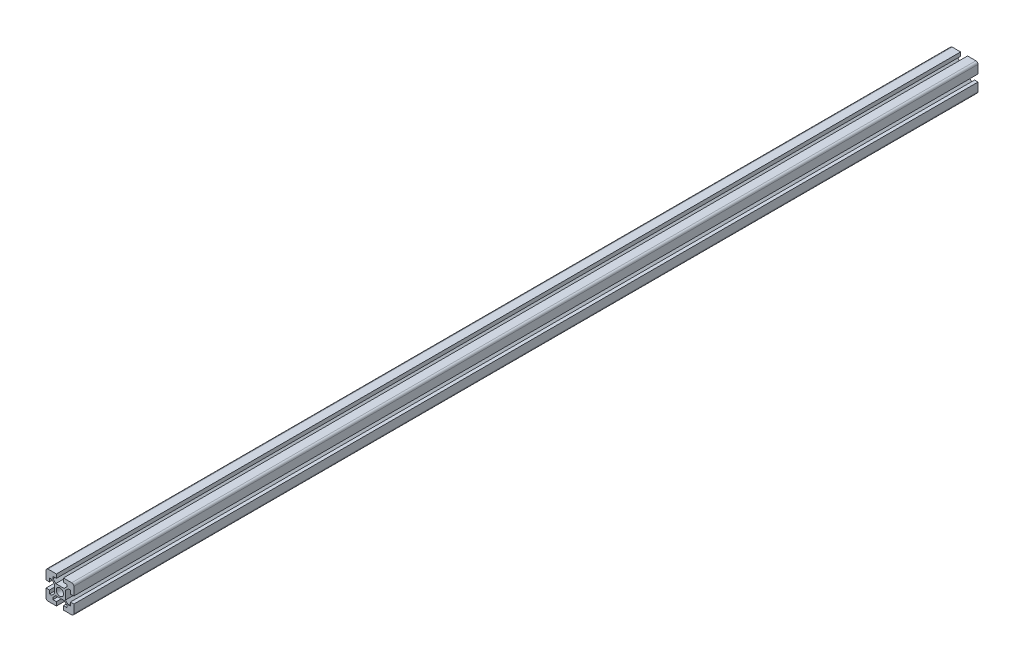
ISO-10303-21;
HEADER;
FILE_DESCRIPTION(('STEP AP214'),'2;1');
FILE_NAME('part.step','',(''),(''),'','','');
FILE_SCHEMA(('AUTOMOTIVE_DESIGN { 1 0 10303 214 1 1 1 1 }'));
ENDSEC;
DATA;
#1=APPLICATION_CONTEXT('core data for automotive mechanical design processes');
#2=APPLICATION_PROTOCOL_DEFINITION('international standard','automotive_design',2000,#1);
#3=PRODUCT_CONTEXT('',#1,'mechanical');
#4=PRODUCT('Part','Part','',(#3));
#5=PRODUCT_RELATED_PRODUCT_CATEGORY('part','',(#4));
#6=PRODUCT_DEFINITION_FORMATION('','',#4);
#7=PRODUCT_DEFINITION_CONTEXT('part definition',#1,'design');
#8=PRODUCT_DEFINITION('design','',#6,#7);
#9=PRODUCT_DEFINITION_SHAPE('','',#8);
#10=(LENGTH_UNIT() NAMED_UNIT(*) SI_UNIT(.MILLI.,.METRE.));
#11=(NAMED_UNIT(*) PLANE_ANGLE_UNIT() SI_UNIT($,.RADIAN.));
#12=(NAMED_UNIT(*) SI_UNIT($,.STERADIAN.) SOLID_ANGLE_UNIT());
#13=UNCERTAINTY_MEASURE_WITH_UNIT(LENGTH_MEASURE(1.E-05),#10,'distance_accuracy_value','');
#14=(GEOMETRIC_REPRESENTATION_CONTEXT(3) GLOBAL_UNCERTAINTY_ASSIGNED_CONTEXT((#13)) GLOBAL_UNIT_ASSIGNED_CONTEXT((#10,
#11,#12)) REPRESENTATION_CONTEXT('',''));
#15=CARTESIAN_POINT('',(0.,0.,0.));
#16=DIRECTION('',(0.,0.,1.));
#17=DIRECTION('',(1.,0.,0.));
#18=AXIS2_PLACEMENT_3D('',#15,#16,#17);
#19=CARTESIAN_POINT('',(20.,0.,1300.));
#20=DIRECTION('',(0.,1.,0.));
#21=DIRECTION('',(0.,0.,1.));
#22=AXIS2_PLACEMENT_3D('',#19,#20,#21);
#23=PLANE('',#22);
#24=DIRECTION('',(1.,0.,0.));
#25=VECTOR('',#24,1.);
#26=CARTESIAN_POINT('',(20.,0.,0.));
#27=LINE('',#26,#25);
#28=CARTESIAN_POINT('',(3.00000000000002,0.,0.));
#29=VERTEX_POINT('',#28);
#30=CARTESIAN_POINT('',(15.,0.,0.));
#31=VERTEX_POINT('',#30);
#32=EDGE_CURVE('E371',#29,#31,#27,.T.);
#33=ORIENTED_EDGE('',*,*,#32,.F.);
#34=DIRECTION('',(0.,0.,-1.));
#35=VECTOR('',#34,1.);
#36=CARTESIAN_POINT('',(3.00000000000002,0.,1300.));
#37=LINE('',#36,#35);
#38=CARTESIAN_POINT('',(3.00000000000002,0.,1300.));
#39=VERTEX_POINT('',#38);
#40=EDGE_CURVE('E11',#39,#29,#37,.T.);
#41=ORIENTED_EDGE('',*,*,#40,.F.);
#42=DIRECTION('',(1.,0.,0.));
#43=VECTOR('',#42,1.);
#44=CARTESIAN_POINT('',(20.,0.,1300.));
#45=LINE('',#44,#43);
#46=CARTESIAN_POINT('',(15.,0.,1300.));
#47=VERTEX_POINT('',#46);
#48=EDGE_CURVE('E823',#39,#47,#45,.T.);
#49=ORIENTED_EDGE('',*,*,#48,.T.);
#50=DIRECTION('',(0.,0.,-1.));
#51=VECTOR('',#50,1.);
#52=CARTESIAN_POINT('',(15.,0.,1300.));
#53=LINE('',#52,#51);
#54=EDGE_CURVE('E50',#47,#31,#53,.T.);
#55=ORIENTED_EDGE('',*,*,#54,.T.);
#56=EDGE_LOOP('',(#33,#41,#49,#55));
#57=FACE_BOUND('',#56,.T.);
#58=ADVANCED_FACE('F33',(#57),#23,.T.);
#59=CARTESIAN_POINT('',(3.,-3.,1300.));
#60=DIRECTION('',(0.,0.,-1.));
#61=DIRECTION('',(-1.,0.,0.));
#62=AXIS2_PLACEMENT_3D('',#59,#60,#61);
#63=CYLINDRICAL_SURFACE('',#62,3.);
#64=CARTESIAN_POINT('',(3.,-3.,0.));
#65=DIRECTION('',(0.,0.,1.));
#66=DIRECTION('',(1.,0.,0.));
#67=AXIS2_PLACEMENT_3D('',#64,#65,#66);
#68=CIRCLE('',#67,3.);
#69=CARTESIAN_POINT('',(0.,-3.00000000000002,0.));
#70=VERTEX_POINT('',#69);
#71=EDGE_CURVE('E373',#29,#70,#68,.T.);
#72=ORIENTED_EDGE('',*,*,#71,.T.);
#73=DIRECTION('',(0.,0.,-1.));
#74=VECTOR('',#73,1.);
#75=CARTESIAN_POINT('',(0.,-3.00000000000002,1300.));
#76=LINE('',#75,#74);
#77=CARTESIAN_POINT('',(0.,-3.00000000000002,1300.));
#78=VERTEX_POINT('',#77);
#79=EDGE_CURVE('E42',#78,#70,#76,.T.);
#80=ORIENTED_EDGE('',*,*,#79,.F.);
#81=CARTESIAN_POINT('',(3.,-3.,1300.));
#82=DIRECTION('',(0.,0.,1.));
#83=DIRECTION('',(1.,0.,0.));
#84=AXIS2_PLACEMENT_3D('',#81,#82,#83);
#85=CIRCLE('',#84,3.);
#86=EDGE_CURVE('E825',#39,#78,#85,.T.);
#87=ORIENTED_EDGE('',*,*,#86,.F.);
#88=ORIENTED_EDGE('',*,*,#40,.T.);
#89=EDGE_LOOP('',(#72,#80,#87,#88));
#90=FACE_BOUND('',#89,.T.);
#91=ADVANCED_FACE('F627',(#90),#63,.T.);
#92=CARTESIAN_POINT('',(0.,-64.1414213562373,1300.));
#93=DIRECTION('',(1.,0.,0.));
#94=DIRECTION('',(0.,1.,0.));
#95=AXIS2_PLACEMENT_3D('',#92,#93,#94);
#96=PLANE('',#95);
#97=DIRECTION('',(0.,-1.,0.));
#98=VECTOR('',#97,1.);
#99=CARTESIAN_POINT('',(0.,-64.1414213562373,0.));
#100=LINE('',#99,#98);
#101=CARTESIAN_POINT('',(0.,-15.,0.));
#102=VERTEX_POINT('',#101);
#103=EDGE_CURVE('E376',#70,#102,#100,.T.);
#104=ORIENTED_EDGE('',*,*,#103,.T.);
#105=DIRECTION('',(0.,0.,-1.));
#106=VECTOR('',#105,1.);
#107=CARTESIAN_POINT('',(0.,-15.,1300.));
#108=LINE('',#107,#106);
#109=CARTESIAN_POINT('',(0.,-15.,1300.));
#110=VERTEX_POINT('',#109);
#111=EDGE_CURVE('E615',#110,#102,#108,.T.);
#112=ORIENTED_EDGE('',*,*,#111,.F.);
#113=DIRECTION('',(0.,-1.,0.));
#114=VECTOR('',#113,1.);
#115=CARTESIAN_POINT('',(0.,-64.1414213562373,1300.));
#116=LINE('',#115,#114);
#117=EDGE_CURVE('E623',#78,#110,#116,.T.);
#118=ORIENTED_EDGE('',*,*,#117,.F.);
#119=ORIENTED_EDGE('',*,*,#79,.T.);
#120=EDGE_LOOP('',(#104,#112,#118,#119));
#121=FACE_BOUND('',#120,.T.);
#122=ADVANCED_FACE('F620',(#121),#96,.F.);
#123=CARTESIAN_POINT('',(20.,-15.,1300.));
#124=DIRECTION('',(0.,1.,0.));
#125=DIRECTION('',(0.,0.,1.));
#126=AXIS2_PLACEMENT_3D('',#123,#124,#125);
#127=PLANE('',#126);
#128=DIRECTION('',(1.,0.,0.));
#129=VECTOR('',#128,1.);
#130=CARTESIAN_POINT('',(20.,-15.,0.));
#131=LINE('',#130,#129);
#132=CARTESIAN_POINT('',(4.99999999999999,-15.,0.));
#133=VERTEX_POINT('',#132);
#134=EDGE_CURVE('E379',#102,#133,#131,.T.);
#135=ORIENTED_EDGE('',*,*,#134,.T.);
#136=DIRECTION('',(0.,0.,-1.));
#137=VECTOR('',#136,1.);
#138=CARTESIAN_POINT('',(4.99999999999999,-15.,1300.));
#139=LINE('',#138,#137);
#140=CARTESIAN_POINT('',(4.99999999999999,-15.,1300.));
#141=VERTEX_POINT('',#140);
#142=EDGE_CURVE('E612',#141,#133,#139,.T.);
#143=ORIENTED_EDGE('',*,*,#142,.F.);
#144=DIRECTION('',(1.,0.,0.));
#145=VECTOR('',#144,1.);
#146=CARTESIAN_POINT('',(20.,-15.,1300.));
#147=LINE('',#146,#145);
#148=EDGE_CURVE('E830',#110,#141,#147,.T.);
#149=ORIENTED_EDGE('',*,*,#148,.F.);
#150=ORIENTED_EDGE('',*,*,#111,.T.);
#151=EDGE_LOOP('',(#135,#143,#149,#150));
#152=FACE_BOUND('',#151,.T.);
#153=ADVANCED_FACE('F638',(#152),#127,.F.);
#154=CARTESIAN_POINT('',(5.,-64.1414213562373,1300.));
#155=DIRECTION('',(-1.,0.,0.));
#156=DIRECTION('',(0.,-1.,0.));
#157=AXIS2_PLACEMENT_3D('',#154,#155,#156);
#158=PLANE('',#157);
#159=DIRECTION('',(0.,1.,0.));
#160=VECTOR('',#159,1.);
#161=CARTESIAN_POINT('',(5.,-64.1414213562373,0.));
#162=LINE('',#161,#160);
#163=CARTESIAN_POINT('',(4.99999999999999,-10.,0.));
#164=VERTEX_POINT('',#163);
#165=EDGE_CURVE('E382',#133,#164,#162,.T.);
#166=ORIENTED_EDGE('',*,*,#165,.T.);
#167=DIRECTION('',(0.,0.,-1.));
#168=VECTOR('',#167,1.);
#169=CARTESIAN_POINT('',(4.99999999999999,-10.,1300.));
#170=LINE('',#169,#168);
#171=CARTESIAN_POINT('',(4.99999999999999,-10.,1300.));
#172=VERTEX_POINT('',#171);
#173=EDGE_CURVE('E609',#172,#164,#170,.T.);
#174=ORIENTED_EDGE('',*,*,#173,.F.);
#175=DIRECTION('',(0.,1.,0.));
#176=VECTOR('',#175,1.);
#177=CARTESIAN_POINT('',(5.,-64.1414213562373,1300.));
#178=LINE('',#177,#176);
#179=EDGE_CURVE('E833',#141,#172,#178,.T.);
#180=ORIENTED_EDGE('',*,*,#179,.F.);
#181=ORIENTED_EDGE('',*,*,#142,.T.);
#182=EDGE_LOOP('',(#166,#174,#180,#181));
#183=FACE_BOUND('',#182,.T.);
#184=ADVANCED_FACE('F641',(#183),#158,.F.);
#185=CARTESIAN_POINT('',(20.,-10.,1300.));
#186=DIRECTION('',(0.,1.,0.));
#187=DIRECTION('',(0.,0.,1.));
#188=AXIS2_PLACEMENT_3D('',#185,#186,#187);
#189=PLANE('',#188);
#190=DIRECTION('',(1.,0.,0.));
#191=VECTOR('',#190,1.);
#192=CARTESIAN_POINT('',(20.,-10.,0.));
#193=LINE('',#192,#191);
#194=CARTESIAN_POINT('',(7.99999999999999,-10.,0.));
#195=VERTEX_POINT('',#194);
#196=EDGE_CURVE('E385',#164,#195,#193,.T.);
#197=ORIENTED_EDGE('',*,*,#196,.T.);
#198=DIRECTION('',(0.,0.,-1.));
#199=VECTOR('',#198,1.);
#200=CARTESIAN_POINT('',(7.99999999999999,-10.,1300.));
#201=LINE('',#200,#199);
#202=CARTESIAN_POINT('',(7.99999999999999,-10.,1300.));
#203=VERTEX_POINT('',#202);
#204=EDGE_CURVE('E606',#203,#195,#201,.T.);
#205=ORIENTED_EDGE('',*,*,#204,.F.);
#206=DIRECTION('',(1.,0.,0.));
#207=VECTOR('',#206,1.);
#208=CARTESIAN_POINT('',(20.,-10.,1300.));
#209=LINE('',#208,#207);
#210=EDGE_CURVE('E836',#172,#203,#209,.T.);
#211=ORIENTED_EDGE('',*,*,#210,.F.);
#212=ORIENTED_EDGE('',*,*,#173,.T.);
#213=EDGE_LOOP('',(#197,#205,#211,#212));
#214=FACE_BOUND('',#213,.T.);
#215=ADVANCED_FACE('F645',(#214),#189,.F.);
#216=CARTESIAN_POINT('',(41.0707106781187,-43.0707106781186,1300.));
#217=DIRECTION('',(0.707106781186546,0.707106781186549,0.));
#218=DIRECTION('',(-0.707106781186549,0.707106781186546,0.));
#219=AXIS2_PLACEMENT_3D('',#216,#217,#218);
#220=PLANE('',#219);
#221=DIRECTION('',(0.707106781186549,-0.707106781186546,0.));
#222=VECTOR('',#221,1.);
#223=CARTESIAN_POINT('',(41.0707106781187,-43.0707106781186,0.));
#224=LINE('',#223,#222);
#225=CARTESIAN_POINT('',(12.,-14.,0.));
#226=VERTEX_POINT('',#225);
#227=EDGE_CURVE('E388',#195,#226,#224,.T.);
#228=ORIENTED_EDGE('',*,*,#227,.T.);
#229=DIRECTION('',(0.,0.,-1.));
#230=VECTOR('',#229,1.);
#231=CARTESIAN_POINT('',(12.,-14.,1300.));
#232=LINE('',#231,#230);
#233=CARTESIAN_POINT('',(12.,-14.,1300.));
#234=VERTEX_POINT('',#233);
#235=EDGE_CURVE('E603',#234,#226,#232,.T.);
#236=ORIENTED_EDGE('',*,*,#235,.F.);
#237=DIRECTION('',(0.707106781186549,-0.707106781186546,0.));
#238=VECTOR('',#237,1.);
#239=CARTESIAN_POINT('',(41.0707106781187,-43.0707106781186,1300.));
#240=LINE('',#239,#238);
#241=EDGE_CURVE('E839',#203,#234,#240,.T.);
#242=ORIENTED_EDGE('',*,*,#241,.F.);
#243=ORIENTED_EDGE('',*,*,#204,.T.);
#244=EDGE_LOOP('',(#228,#236,#242,#243));
#245=FACE_BOUND('',#244,.T.);
#246=ADVANCED_FACE('F649',(#245),#220,.F.);
#247=CARTESIAN_POINT('',(12.,-64.1414213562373,1300.));
#248=DIRECTION('',(1.,0.,0.));
#249=DIRECTION('',(0.,1.,0.));
#250=AXIS2_PLACEMENT_3D('',#247,#248,#249);
#251=PLANE('',#250);
#252=DIRECTION('',(0.,-1.,0.));
#253=VECTOR('',#252,1.);
#254=CARTESIAN_POINT('',(12.,-64.1414213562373,0.));
#255=LINE('',#254,#253);
#256=CARTESIAN_POINT('',(12.,-26.,0.));
#257=VERTEX_POINT('',#256);
#258=EDGE_CURVE('E391',#226,#257,#255,.T.);
#259=ORIENTED_EDGE('',*,*,#258,.T.);
#260=DIRECTION('',(0.,0.,-1.));
#261=VECTOR('',#260,1.);
#262=CARTESIAN_POINT('',(12.,-26.,1300.));
#263=LINE('',#262,#261);
#264=CARTESIAN_POINT('',(12.,-26.,1300.));
#265=VERTEX_POINT('',#264);
#266=EDGE_CURVE('E600',#265,#257,#263,.T.);
#267=ORIENTED_EDGE('',*,*,#266,.F.);
#268=DIRECTION('',(0.,-1.,0.));
#269=VECTOR('',#268,1.);
#270=CARTESIAN_POINT('',(12.,-64.1414213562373,1300.));
#271=LINE('',#270,#269);
#272=EDGE_CURVE('E842',#234,#265,#271,.T.);
#273=ORIENTED_EDGE('',*,*,#272,.F.);
#274=ORIENTED_EDGE('',*,*,#235,.T.);
#275=EDGE_LOOP('',(#259,#267,#273,#274));
#276=FACE_BOUND('',#275,.T.);
#277=ADVANCED_FACE('F653',(#276),#251,.F.);
#278=CARTESIAN_POINT('',(-3.07071067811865,-41.0707106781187,1300.));
#279=DIRECTION('',(0.707106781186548,-0.707106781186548,0.));
#280=DIRECTION('',(0.707106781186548,0.707106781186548,0.));
#281=AXIS2_PLACEMENT_3D('',#278,#279,#280);
#282=PLANE('',#281);
#283=DIRECTION('',(-0.707106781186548,-0.707106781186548,0.));
#284=VECTOR('',#283,1.);
#285=CARTESIAN_POINT('',(-3.07071067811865,-41.0707106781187,0.));
#286=LINE('',#285,#284);
#287=CARTESIAN_POINT('',(8.00000000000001,-30.,0.));
#288=VERTEX_POINT('',#287);
#289=EDGE_CURVE('E394',#257,#288,#286,.T.);
#290=ORIENTED_EDGE('',*,*,#289,.T.);
#291=DIRECTION('',(0.,0.,-1.));
#292=VECTOR('',#291,1.);
#293=CARTESIAN_POINT('',(8.00000000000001,-30.,1300.));
#294=LINE('',#293,#292);
#295=CARTESIAN_POINT('',(8.00000000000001,-30.,1300.));
#296=VERTEX_POINT('',#295);
#297=EDGE_CURVE('E597',#296,#288,#294,.T.);
#298=ORIENTED_EDGE('',*,*,#297,.F.);
#299=DIRECTION('',(-0.707106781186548,-0.707106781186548,0.));
#300=VECTOR('',#299,1.);
#301=CARTESIAN_POINT('',(-3.07071067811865,-41.0707106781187,1300.));
#302=LINE('',#301,#300);
#303=EDGE_CURVE('E845',#265,#296,#302,.T.);
#304=ORIENTED_EDGE('',*,*,#303,.F.);
#305=ORIENTED_EDGE('',*,*,#266,.T.);
#306=EDGE_LOOP('',(#290,#298,#304,#305));
#307=FACE_BOUND('',#306,.T.);
#308=ADVANCED_FACE('F657',(#307),#282,.F.);
#309=CARTESIAN_POINT('',(20.,-30.,1300.));
#310=DIRECTION('',(0.,-1.,0.));
#311=DIRECTION('',(0.,0.,-1.));
#312=AXIS2_PLACEMENT_3D('',#309,#310,#311);
#313=PLANE('',#312);
#314=DIRECTION('',(-1.,0.,0.));
#315=VECTOR('',#314,1.);
#316=CARTESIAN_POINT('',(20.,-30.,0.));
#317=LINE('',#316,#315);
#318=CARTESIAN_POINT('',(5.,-30.,0.));
#319=VERTEX_POINT('',#318);
#320=EDGE_CURVE('E397',#288,#319,#317,.T.);
#321=ORIENTED_EDGE('',*,*,#320,.T.);
#322=DIRECTION('',(0.,0.,-1.));
#323=VECTOR('',#322,1.);
#324=CARTESIAN_POINT('',(5.,-30.,1300.));
#325=LINE('',#324,#323);
#326=CARTESIAN_POINT('',(5.,-30.,1300.));
#327=VERTEX_POINT('',#326);
#328=EDGE_CURVE('E594',#327,#319,#325,.T.);
#329=ORIENTED_EDGE('',*,*,#328,.F.);
#330=DIRECTION('',(-1.,0.,0.));
#331=VECTOR('',#330,1.);
#332=CARTESIAN_POINT('',(20.,-30.,1300.));
#333=LINE('',#332,#331);
#334=EDGE_CURVE('E848',#296,#327,#333,.T.);
#335=ORIENTED_EDGE('',*,*,#334,.F.);
#336=ORIENTED_EDGE('',*,*,#297,.T.);
#337=EDGE_LOOP('',(#321,#329,#335,#336));
#338=FACE_BOUND('',#337,.T.);
#339=ADVANCED_FACE('F661',(#338),#313,.F.);
#340=CARTESIAN_POINT('',(5.,-64.1414213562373,1300.));
#341=DIRECTION('',(-1.,0.,0.));
#342=DIRECTION('',(0.,0.,1.));
#343=AXIS2_PLACEMENT_3D('',#340,#341,#342);
#344=PLANE('',#343);
#345=DIRECTION('',(0.,1.,0.));
#346=VECTOR('',#345,1.);
#347=CARTESIAN_POINT('',(5.,-64.1414213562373,0.));
#348=LINE('',#347,#346);
#349=CARTESIAN_POINT('',(5.,-25.,0.));
#350=VERTEX_POINT('',#349);
#351=EDGE_CURVE('E400',#319,#350,#348,.T.);
#352=ORIENTED_EDGE('',*,*,#351,.T.);
#353=DIRECTION('',(0.,0.,-1.));
#354=VECTOR('',#353,1.);
#355=CARTESIAN_POINT('',(5.,-25.,1300.));
#356=LINE('',#355,#354);
#357=CARTESIAN_POINT('',(5.,-25.,1300.));
#358=VERTEX_POINT('',#357);
#359=EDGE_CURVE('E592',#358,#350,#356,.T.);
#360=ORIENTED_EDGE('',*,*,#359,.F.);
#361=DIRECTION('',(0.,1.,0.));
#362=VECTOR('',#361,1.);
#363=CARTESIAN_POINT('',(5.,-64.1414213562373,1300.));
#364=LINE('',#363,#362);
#365=EDGE_CURVE('E851',#327,#358,#364,.T.);
#366=ORIENTED_EDGE('',*,*,#365,.F.);
#367=ORIENTED_EDGE('',*,*,#328,.T.);
#368=EDGE_LOOP('',(#352,#360,#366,#367));
#369=FACE_BOUND('',#368,.T.);
#370=ADVANCED_FACE('F665',(#369),#344,.F.);
#371=CARTESIAN_POINT('',(20.,-25.,1300.));
#372=DIRECTION('',(0.,1.,0.));
#373=DIRECTION('',(0.,0.,1.));
#374=AXIS2_PLACEMENT_3D('',#371,#372,#373);
#375=PLANE('',#374);
#376=DIRECTION('',(1.,0.,0.));
#377=VECTOR('',#376,1.);
#378=CARTESIAN_POINT('',(20.,-25.,0.));
#379=LINE('',#378,#377);
#380=CARTESIAN_POINT('',(0.,-25.,0.));
#381=VERTEX_POINT('',#380);
#382=EDGE_CURVE('E403',#381,#350,#379,.T.);
#383=ORIENTED_EDGE('',*,*,#382,.F.);
#384=DIRECTION('',(0.,0.,-1.));
#385=VECTOR('',#384,1.);
#386=CARTESIAN_POINT('',(0.,-25.,1300.));
#387=LINE('',#386,#385);
#388=CARTESIAN_POINT('',(0.,-25.,1300.));
#389=VERTEX_POINT('',#388);
#390=EDGE_CURVE('E590',#389,#381,#387,.T.);
#391=ORIENTED_EDGE('',*,*,#390,.F.);
#392=DIRECTION('',(1.,0.,0.));
#393=VECTOR('',#392,1.);
#394=CARTESIAN_POINT('',(20.,-25.,1300.));
#395=LINE('',#394,#393);
#396=EDGE_CURVE('E853',#389,#358,#395,.T.);
#397=ORIENTED_EDGE('',*,*,#396,.T.);
#398=ORIENTED_EDGE('',*,*,#359,.T.);
#399=EDGE_LOOP('',(#383,#391,#397,#398));
#400=FACE_BOUND('',#399,.T.);
#401=ADVANCED_FACE('F669',(#400),#375,.T.);
#402=CARTESIAN_POINT('',(0.,-64.1414213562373,1300.));
#403=DIRECTION('',(1.,0.,0.));
#404=DIRECTION('',(0.,1.,0.));
#405=AXIS2_PLACEMENT_3D('',#402,#403,#404);
#406=PLANE('',#405);
#407=DIRECTION('',(0.,-1.,0.));
#408=VECTOR('',#407,1.);
#409=CARTESIAN_POINT('',(0.,-64.1414213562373,0.));
#410=LINE('',#409,#408);
#411=CARTESIAN_POINT('',(0.,-37.,0.));
#412=VERTEX_POINT('',#411);
#413=EDGE_CURVE('E406',#381,#412,#410,.T.);
#414=ORIENTED_EDGE('',*,*,#413,.T.);
#415=DIRECTION('',(0.,0.,-1.));
#416=VECTOR('',#415,1.);
#417=CARTESIAN_POINT('',(0.,-37.,1300.));
#418=LINE('',#417,#416);
#419=CARTESIAN_POINT('',(0.,-37.,1300.));
#420=VERTEX_POINT('',#419);
#421=EDGE_CURVE('E587',#420,#412,#418,.T.);
#422=ORIENTED_EDGE('',*,*,#421,.F.);
#423=DIRECTION('',(0.,-1.,0.));
#424=VECTOR('',#423,1.);
#425=CARTESIAN_POINT('',(0.,-64.1414213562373,1300.));
#426=LINE('',#425,#424);
#427=EDGE_CURVE('E856',#389,#420,#426,.T.);
#428=ORIENTED_EDGE('',*,*,#427,.F.);
#429=ORIENTED_EDGE('',*,*,#390,.T.);
#430=EDGE_LOOP('',(#414,#422,#428,#429));
#431=FACE_BOUND('',#430,.T.);
#432=ADVANCED_FACE('F673',(#431),#406,.F.);
#433=CARTESIAN_POINT('',(3.,-37.,1300.));
#434=DIRECTION('',(0.,0.,-1.));
#435=DIRECTION('',(-1.,0.,0.));
#436=AXIS2_PLACEMENT_3D('',#433,#434,#435);
#437=CYLINDRICAL_SURFACE('',#436,3.);
#438=CARTESIAN_POINT('',(3.,-37.,0.));
#439=DIRECTION('',(0.,0.,1.));
#440=DIRECTION('',(1.,0.,0.));
#441=AXIS2_PLACEMENT_3D('',#438,#439,#440);
#442=CIRCLE('',#441,3.);
#443=CARTESIAN_POINT('',(3.00000000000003,-40.,0.));
#444=VERTEX_POINT('',#443);
#445=EDGE_CURVE('E409',#412,#444,#442,.T.);
#446=ORIENTED_EDGE('',*,*,#445,.T.);
#447=DIRECTION('',(0.,0.,-1.));
#448=VECTOR('',#447,1.);
#449=CARTESIAN_POINT('',(3.00000000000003,-40.,1300.));
#450=LINE('',#449,#448);
#451=CARTESIAN_POINT('',(3.00000000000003,-40.,1300.));
#452=VERTEX_POINT('',#451);
#453=EDGE_CURVE('E584',#452,#444,#450,.T.);
#454=ORIENTED_EDGE('',*,*,#453,.F.);
#455=CARTESIAN_POINT('',(3.,-37.,1300.));
#456=DIRECTION('',(0.,0.,1.));
#457=DIRECTION('',(1.,0.,0.));
#458=AXIS2_PLACEMENT_3D('',#455,#456,#457);
#459=CIRCLE('',#458,3.);
#460=EDGE_CURVE('E859',#420,#452,#459,.T.);
#461=ORIENTED_EDGE('',*,*,#460,.F.);
#462=ORIENTED_EDGE('',*,*,#421,.T.);
#463=EDGE_LOOP('',(#446,#454,#461,#462));
#464=FACE_BOUND('',#463,.T.);
#465=ADVANCED_FACE('F677',(#464),#437,.T.);
#466=CARTESIAN_POINT('',(20.,-40.,1300.));
#467=DIRECTION('',(0.,1.,0.));
#468=DIRECTION('',(0.,0.,1.));
#469=AXIS2_PLACEMENT_3D('',#466,#467,#468);
#470=PLANE('',#469);
#471=DIRECTION('',(1.,0.,0.));
#472=VECTOR('',#471,1.);
#473=CARTESIAN_POINT('',(20.,-40.,0.));
#474=LINE('',#473,#472);
#475=CARTESIAN_POINT('',(15.,-40.,0.));
#476=VERTEX_POINT('',#475);
#477=EDGE_CURVE('E412',#444,#476,#474,.T.);
#478=ORIENTED_EDGE('',*,*,#477,.T.);
#479=DIRECTION('',(0.,0.,-1.));
#480=VECTOR('',#479,1.);
#481=CARTESIAN_POINT('',(15.,-40.,1300.));
#482=LINE('',#481,#480);
#483=CARTESIAN_POINT('',(15.,-40.,1300.));
#484=VERTEX_POINT('',#483);
#485=EDGE_CURVE('E581',#484,#476,#482,.T.);
#486=ORIENTED_EDGE('',*,*,#485,.F.);
#487=DIRECTION('',(1.,0.,0.));
#488=VECTOR('',#487,1.);
#489=CARTESIAN_POINT('',(20.,-40.,1300.));
#490=LINE('',#489,#488);
#491=EDGE_CURVE('E862',#452,#484,#490,.T.);
#492=ORIENTED_EDGE('',*,*,#491,.F.);
#493=ORIENTED_EDGE('',*,*,#453,.T.);
#494=EDGE_LOOP('',(#478,#486,#492,#493));
#495=FACE_BOUND('',#494,.T.);
#496=ADVANCED_FACE('F681',(#495),#470,.F.);
#497=CARTESIAN_POINT('',(15.,-64.1414213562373,1300.));
#498=DIRECTION('',(-1.,0.,0.));
#499=DIRECTION('',(0.,-1.,0.));
#500=AXIS2_PLACEMENT_3D('',#497,#498,#499);
#501=PLANE('',#500);
#502=DIRECTION('',(0.,1.,0.));
#503=VECTOR('',#502,1.);
#504=CARTESIAN_POINT('',(15.,-64.1414213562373,0.));
#505=LINE('',#504,#503);
#506=CARTESIAN_POINT('',(15.,-34.5,0.));
#507=VERTEX_POINT('',#506);
#508=EDGE_CURVE('E415',#476,#507,#505,.T.);
#509=ORIENTED_EDGE('',*,*,#508,.T.);
#510=DIRECTION('',(0.,0.,-1.));
#511=VECTOR('',#510,1.);
#512=CARTESIAN_POINT('',(15.,-34.5,1300.));
#513=LINE('',#512,#511);
#514=CARTESIAN_POINT('',(15.,-34.5,1300.));
#515=VERTEX_POINT('',#514);
#516=EDGE_CURVE('E578',#515,#507,#513,.T.);
#517=ORIENTED_EDGE('',*,*,#516,.F.);
#518=DIRECTION('',(0.,1.,0.));
#519=VECTOR('',#518,1.);
#520=CARTESIAN_POINT('',(15.,-64.1414213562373,1300.));
#521=LINE('',#520,#519);
#522=EDGE_CURVE('E865',#484,#515,#521,.T.);
#523=ORIENTED_EDGE('',*,*,#522,.F.);
#524=ORIENTED_EDGE('',*,*,#485,.T.);
#525=EDGE_LOOP('',(#509,#517,#523,#524));
#526=FACE_BOUND('',#525,.T.);
#527=ADVANCED_FACE('F685',(#526),#501,.F.);
#528=CARTESIAN_POINT('',(20.,-34.5,1300.));
#529=DIRECTION('',(0.,-1.,0.));
#530=DIRECTION('',(0.,0.,-1.));
#531=AXIS2_PLACEMENT_3D('',#528,#529,#530);
#532=PLANE('',#531);
#533=DIRECTION('',(-1.,0.,0.));
#534=VECTOR('',#533,1.);
#535=CARTESIAN_POINT('',(20.,-34.5,0.));
#536=LINE('',#535,#534);
#537=CARTESIAN_POINT('',(10.,-34.5,0.));
#538=VERTEX_POINT('',#537);
#539=EDGE_CURVE('E418',#507,#538,#536,.T.);
#540=ORIENTED_EDGE('',*,*,#539,.T.);
#541=DIRECTION('',(0.,0.,-1.));
#542=VECTOR('',#541,1.);
#543=CARTESIAN_POINT('',(10.,-34.5,1300.));
#544=LINE('',#543,#542);
#545=CARTESIAN_POINT('',(10.,-34.5,1300.));
#546=VERTEX_POINT('',#545);
#547=EDGE_CURVE('E575',#546,#538,#544,.T.);
#548=ORIENTED_EDGE('',*,*,#547,.F.);
#549=DIRECTION('',(-1.,0.,0.));
#550=VECTOR('',#549,1.);
#551=CARTESIAN_POINT('',(20.,-34.5,1300.));
#552=LINE('',#551,#550);
#553=EDGE_CURVE('E868',#515,#546,#552,.T.);
#554=ORIENTED_EDGE('',*,*,#553,.F.);
#555=ORIENTED_EDGE('',*,*,#516,.T.);
#556=EDGE_LOOP('',(#540,#548,#554,#555));
#557=FACE_BOUND('',#556,.T.);
#558=ADVANCED_FACE('F689',(#557),#532,.F.);
#559=CARTESIAN_POINT('',(10.,-64.1414213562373,1300.));
#560=DIRECTION('',(-1.,0.,0.));
#561=DIRECTION('',(0.,0.,1.));
#562=AXIS2_PLACEMENT_3D('',#559,#560,#561);
#563=PLANE('',#562);
#564=DIRECTION('',(0.,1.,0.));
#565=VECTOR('',#564,1.);
#566=CARTESIAN_POINT('',(10.,-64.1414213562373,0.));
#567=LINE('',#566,#565);
#568=CARTESIAN_POINT('',(10.,-31.5,0.));
#569=VERTEX_POINT('',#568);
#570=EDGE_CURVE('E421',#538,#569,#567,.T.);
#571=ORIENTED_EDGE('',*,*,#570,.T.);
#572=DIRECTION('',(0.,0.,-1.));
#573=VECTOR('',#572,1.);
#574=CARTESIAN_POINT('',(10.,-31.5,1300.));
#575=LINE('',#574,#573);
#576=CARTESIAN_POINT('',(10.,-31.5,1300.));
#577=VERTEX_POINT('',#576);
#578=EDGE_CURVE('E572',#577,#569,#575,.T.);
#579=ORIENTED_EDGE('',*,*,#578,.F.);
#580=DIRECTION('',(0.,1.,0.));
#581=VECTOR('',#580,1.);
#582=CARTESIAN_POINT('',(10.,-64.1414213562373,1300.));
#583=LINE('',#582,#581);
#584=EDGE_CURVE('E871',#546,#577,#583,.T.);
#585=ORIENTED_EDGE('',*,*,#584,.F.);
#586=ORIENTED_EDGE('',*,*,#547,.T.);
#587=EDGE_LOOP('',(#571,#579,#585,#586));
#588=FACE_BOUND('',#587,.T.);
#589=ADVANCED_FACE('F693',(#588),#563,.F.);
#590=CARTESIAN_POINT('',(-1.32071067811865,-42.8207106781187,1300.));
#591=DIRECTION('',(-0.707106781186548,0.707106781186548,0.));
#592=DIRECTION('',(-0.707106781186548,-0.707106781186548,0.));
#593=AXIS2_PLACEMENT_3D('',#590,#591,#592);
#594=PLANE('',#593);
#595=DIRECTION('',(0.707106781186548,0.707106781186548,0.));
#596=VECTOR('',#595,1.);
#597=CARTESIAN_POINT('',(-1.32071067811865,-42.8207106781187,0.));
#598=LINE('',#597,#596);
#599=CARTESIAN_POINT('',(14.,-27.5,0.));
#600=VERTEX_POINT('',#599);
#601=EDGE_CURVE('E424',#569,#600,#598,.T.);
#602=ORIENTED_EDGE('',*,*,#601,.T.);
#603=DIRECTION('',(0.,0.,-1.));
#604=VECTOR('',#603,1.);
#605=CARTESIAN_POINT('',(14.,-27.5,1300.));
#606=LINE('',#605,#604);
#607=CARTESIAN_POINT('',(14.,-27.5,1300.));
#608=VERTEX_POINT('',#607);
#609=EDGE_CURVE('E569',#608,#600,#606,.T.);
#610=ORIENTED_EDGE('',*,*,#609,.F.);
#611=DIRECTION('',(0.707106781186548,0.707106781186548,0.));
#612=VECTOR('',#611,1.);
#613=CARTESIAN_POINT('',(-1.32071067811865,-42.8207106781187,1300.));
#614=LINE('',#613,#612);
#615=EDGE_CURVE('E874',#577,#608,#614,.T.);
#616=ORIENTED_EDGE('',*,*,#615,.F.);
#617=ORIENTED_EDGE('',*,*,#578,.T.);
#618=EDGE_LOOP('',(#602,#610,#616,#617));
#619=FACE_BOUND('',#618,.T.);
#620=ADVANCED_FACE('F697',(#619),#594,.F.);
#621=CARTESIAN_POINT('',(20.,-27.5,1300.));
#622=DIRECTION('',(0.,1.,0.));
#623=DIRECTION('',(0.,0.,1.));
#624=AXIS2_PLACEMENT_3D('',#621,#622,#623);
#625=PLANE('',#624);
#626=DIRECTION('',(1.,0.,0.));
#627=VECTOR('',#626,1.);
#628=CARTESIAN_POINT('',(20.,-27.5,0.));
#629=LINE('',#628,#627);
#630=CARTESIAN_POINT('',(26.,-27.5,0.));
#631=VERTEX_POINT('',#630);
#632=EDGE_CURVE('E427',#600,#631,#629,.T.);
#633=ORIENTED_EDGE('',*,*,#632,.T.);
#634=DIRECTION('',(0.,0.,-1.));
#635=VECTOR('',#634,1.);
#636=CARTESIAN_POINT('',(26.,-27.5,1300.));
#637=LINE('',#636,#635);
#638=CARTESIAN_POINT('',(26.,-27.5,1300.));
#639=VERTEX_POINT('',#638);
#640=EDGE_CURVE('E566',#639,#631,#637,.T.);
#641=ORIENTED_EDGE('',*,*,#640,.F.);
#642=DIRECTION('',(1.,0.,0.));
#643=VECTOR('',#642,1.);
#644=CARTESIAN_POINT('',(20.,-27.5,1300.));
#645=LINE('',#644,#643);
#646=EDGE_CURVE('E877',#608,#639,#645,.T.);
#647=ORIENTED_EDGE('',*,*,#646,.F.);
#648=ORIENTED_EDGE('',*,*,#609,.T.);
#649=EDGE_LOOP('',(#633,#641,#647,#648));
#650=FACE_BOUND('',#649,.T.);
#651=ADVANCED_FACE('F701',(#650),#625,.F.);
#652=CARTESIAN_POINT('',(41.3207106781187,-42.8207106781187,1300.));
#653=DIRECTION('',(0.707106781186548,0.707106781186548,0.));
#654=DIRECTION('',(-0.707106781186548,0.707106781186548,0.));
#655=AXIS2_PLACEMENT_3D('',#652,#653,#654);
#656=PLANE('',#655);
#657=DIRECTION('',(0.707106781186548,-0.707106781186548,0.));
#658=VECTOR('',#657,1.);
#659=CARTESIAN_POINT('',(41.3207106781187,-42.8207106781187,0.));
#660=LINE('',#659,#658);
#661=CARTESIAN_POINT('',(30.,-31.5,0.));
#662=VERTEX_POINT('',#661);
#663=EDGE_CURVE('E430',#631,#662,#660,.T.);
#664=ORIENTED_EDGE('',*,*,#663,.T.);
#665=DIRECTION('',(0.,0.,-1.));
#666=VECTOR('',#665,1.);
#667=CARTESIAN_POINT('',(30.,-31.5,1300.));
#668=LINE('',#667,#666);
#669=CARTESIAN_POINT('',(30.,-31.5,1300.));
#670=VERTEX_POINT('',#669);
#671=EDGE_CURVE('E563',#670,#662,#668,.T.);
#672=ORIENTED_EDGE('',*,*,#671,.F.);
#673=DIRECTION('',(0.707106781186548,-0.707106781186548,0.));
#674=VECTOR('',#673,1.);
#675=CARTESIAN_POINT('',(41.3207106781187,-42.8207106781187,1300.));
#676=LINE('',#675,#674);
#677=EDGE_CURVE('E880',#639,#670,#676,.T.);
#678=ORIENTED_EDGE('',*,*,#677,.F.);
#679=ORIENTED_EDGE('',*,*,#640,.T.);
#680=EDGE_LOOP('',(#664,#672,#678,#679));
#681=FACE_BOUND('',#680,.T.);
#682=ADVANCED_FACE('F705',(#681),#656,.F.);
#683=CARTESIAN_POINT('',(30.,-64.1414213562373,1300.));
#684=DIRECTION('',(1.,0.,0.));
#685=DIRECTION('',(0.,0.,-1.));
#686=AXIS2_PLACEMENT_3D('',#683,#684,#685);
#687=PLANE('',#686);
#688=DIRECTION('',(0.,-1.,0.));
#689=VECTOR('',#688,1.);
#690=CARTESIAN_POINT('',(30.,-64.1414213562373,0.));
#691=LINE('',#690,#689);
#692=CARTESIAN_POINT('',(30.,-34.5,0.));
#693=VERTEX_POINT('',#692);
#694=EDGE_CURVE('E433',#662,#693,#691,.T.);
#695=ORIENTED_EDGE('',*,*,#694,.T.);
#696=DIRECTION('',(0.,0.,-1.));
#697=VECTOR('',#696,1.);
#698=CARTESIAN_POINT('',(30.,-34.5,1300.));
#699=LINE('',#698,#697);
#700=CARTESIAN_POINT('',(30.,-34.5,1300.));
#701=VERTEX_POINT('',#700);
#702=EDGE_CURVE('E560',#701,#693,#699,.T.);
#703=ORIENTED_EDGE('',*,*,#702,.F.);
#704=DIRECTION('',(0.,-1.,0.));
#705=VECTOR('',#704,1.);
#706=CARTESIAN_POINT('',(30.,-64.1414213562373,1300.));
#707=LINE('',#706,#705);
#708=EDGE_CURVE('E883',#670,#701,#707,.T.);
#709=ORIENTED_EDGE('',*,*,#708,.F.);
#710=ORIENTED_EDGE('',*,*,#671,.T.);
#711=EDGE_LOOP('',(#695,#703,#709,#710));
#712=FACE_BOUND('',#711,.T.);
#713=ADVANCED_FACE('F709',(#712),#687,.F.);
#714=CARTESIAN_POINT('',(20.,-34.5,1300.));
#715=DIRECTION('',(0.,-1.,0.));
#716=DIRECTION('',(1.,0.,0.));
#717=AXIS2_PLACEMENT_3D('',#714,#715,#716);
#718=PLANE('',#717);
#719=DIRECTION('',(-1.,0.,0.));
#720=VECTOR('',#719,1.);
#721=CARTESIAN_POINT('',(20.,-34.5,0.));
#722=LINE('',#721,#720);
#723=CARTESIAN_POINT('',(25.,-34.5,0.));
#724=VERTEX_POINT('',#723);
#725=EDGE_CURVE('E436',#693,#724,#722,.T.);
#726=ORIENTED_EDGE('',*,*,#725,.T.);
#727=DIRECTION('',(0.,0.,-1.));
#728=VECTOR('',#727,1.);
#729=CARTESIAN_POINT('',(25.,-34.5,1300.));
#730=LINE('',#729,#728);
#731=CARTESIAN_POINT('',(25.,-34.5,1300.));
#732=VERTEX_POINT('',#731);
#733=EDGE_CURVE('E558',#732,#724,#730,.T.);
#734=ORIENTED_EDGE('',*,*,#733,.F.);
#735=DIRECTION('',(-1.,0.,0.));
#736=VECTOR('',#735,1.);
#737=CARTESIAN_POINT('',(20.,-34.5,1300.));
#738=LINE('',#737,#736);
#739=EDGE_CURVE('E886',#701,#732,#738,.T.);
#740=ORIENTED_EDGE('',*,*,#739,.F.);
#741=ORIENTED_EDGE('',*,*,#702,.T.);
#742=EDGE_LOOP('',(#726,#734,#740,#741));
#743=FACE_BOUND('',#742,.T.);
#744=ADVANCED_FACE('F713',(#743),#718,.F.);
#745=CARTESIAN_POINT('',(25.,-64.1414213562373,1300.));
#746=DIRECTION('',(-1.,0.,0.));
#747=DIRECTION('',(0.,0.,1.));
#748=AXIS2_PLACEMENT_3D('',#745,#746,#747);
#749=PLANE('',#748);
#750=DIRECTION('',(0.,1.,0.));
#751=VECTOR('',#750,1.);
#752=CARTESIAN_POINT('',(25.,-64.1414213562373,0.));
#753=LINE('',#752,#751);
#754=CARTESIAN_POINT('',(25.,-40.,0.));
#755=VERTEX_POINT('',#754);
#756=EDGE_CURVE('E439',#755,#724,#753,.T.);
#757=ORIENTED_EDGE('',*,*,#756,.F.);
#758=DIRECTION('',(0.,0.,-1.));
#759=VECTOR('',#758,1.);
#760=CARTESIAN_POINT('',(25.,-40.,1300.));
#761=LINE('',#760,#759);
#762=CARTESIAN_POINT('',(25.,-40.,1300.));
#763=VERTEX_POINT('',#762);
#764=EDGE_CURVE('E556',#763,#755,#761,.T.);
#765=ORIENTED_EDGE('',*,*,#764,.F.);
#766=DIRECTION('',(0.,1.,0.));
#767=VECTOR('',#766,1.);
#768=CARTESIAN_POINT('',(25.,-64.1414213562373,1300.));
#769=LINE('',#768,#767);
#770=EDGE_CURVE('E888',#763,#732,#769,.T.);
#771=ORIENTED_EDGE('',*,*,#770,.T.);
#772=ORIENTED_EDGE('',*,*,#733,.T.);
#773=EDGE_LOOP('',(#757,#765,#771,#772));
#774=FACE_BOUND('',#773,.T.);
#775=ADVANCED_FACE('F717',(#774),#749,.T.);
#776=CARTESIAN_POINT('',(20.,-40.,1300.));
#777=DIRECTION('',(0.,1.,0.));
#778=DIRECTION('',(0.,0.,1.));
#779=AXIS2_PLACEMENT_3D('',#776,#777,#778);
#780=PLANE('',#779);
#781=DIRECTION('',(1.,0.,0.));
#782=VECTOR('',#781,1.);
#783=CARTESIAN_POINT('',(20.,-40.,0.));
#784=LINE('',#783,#782);
#785=CARTESIAN_POINT('',(37.,-40.,0.));
#786=VERTEX_POINT('',#785);
#787=EDGE_CURVE('E442',#755,#786,#784,.T.);
#788=ORIENTED_EDGE('',*,*,#787,.T.);
#789=DIRECTION('',(0.,0.,-1.));
#790=VECTOR('',#789,1.);
#791=CARTESIAN_POINT('',(37.,-40.,1300.));
#792=LINE('',#791,#790);
#793=CARTESIAN_POINT('',(37.,-40.,1300.));
#794=VERTEX_POINT('',#793);
#795=EDGE_CURVE('E553',#794,#786,#792,.T.);
#796=ORIENTED_EDGE('',*,*,#795,.F.);
#797=DIRECTION('',(1.,0.,0.));
#798=VECTOR('',#797,1.);
#799=CARTESIAN_POINT('',(20.,-40.,1300.));
#800=LINE('',#799,#798);
#801=EDGE_CURVE('E891',#763,#794,#800,.T.);
#802=ORIENTED_EDGE('',*,*,#801,.F.);
#803=ORIENTED_EDGE('',*,*,#764,.T.);
#804=EDGE_LOOP('',(#788,#796,#802,#803));
#805=FACE_BOUND('',#804,.T.);
#806=ADVANCED_FACE('F721',(#805),#780,.F.);
#807=CARTESIAN_POINT('',(37.,-37.,1300.));
#808=DIRECTION('',(0.,0.,-1.));
#809=DIRECTION('',(-1.,0.,0.));
#810=AXIS2_PLACEMENT_3D('',#807,#808,#809);
#811=CYLINDRICAL_SURFACE('',#810,3.);
#812=CARTESIAN_POINT('',(37.,-37.,0.));
#813=DIRECTION('',(0.,0.,1.));
#814=DIRECTION('',(1.,0.,0.));
#815=AXIS2_PLACEMENT_3D('',#812,#813,#814);
#816=CIRCLE('',#815,3.);
#817=CARTESIAN_POINT('',(40.,-37.,0.));
#818=VERTEX_POINT('',#817);
#819=EDGE_CURVE('E445',#786,#818,#816,.T.);
#820=ORIENTED_EDGE('',*,*,#819,.T.);
#821=DIRECTION('',(0.,0.,-1.));
#822=VECTOR('',#821,1.);
#823=CARTESIAN_POINT('',(40.,-37.,1300.));
#824=LINE('',#823,#822);
#825=CARTESIAN_POINT('',(40.,-37.,1300.));
#826=VERTEX_POINT('',#825);
#827=EDGE_CURVE('E551',#826,#818,#824,.T.);
#828=ORIENTED_EDGE('',*,*,#827,.F.);
#829=CARTESIAN_POINT('',(37.,-37.,1300.));
#830=DIRECTION('',(0.,0.,1.));
#831=DIRECTION('',(1.,0.,0.));
#832=AXIS2_PLACEMENT_3D('',#829,#830,#831);
#833=CIRCLE('',#832,3.);
#834=EDGE_CURVE('E894',#794,#826,#833,.T.);
#835=ORIENTED_EDGE('',*,*,#834,.F.);
#836=ORIENTED_EDGE('',*,*,#795,.T.);
#837=EDGE_LOOP('',(#820,#828,#835,#836));
#838=FACE_BOUND('',#837,.T.);
#839=ADVANCED_FACE('F725',(#838),#811,.T.);
#840=CARTESIAN_POINT('',(40.,-64.1414213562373,1300.));
#841=DIRECTION('',(1.,0.,0.));
#842=DIRECTION('',(0.,1.,0.));
#843=AXIS2_PLACEMENT_3D('',#840,#841,#842);
#844=PLANE('',#843);
#845=DIRECTION('',(0.,-1.,0.));
#846=VECTOR('',#845,1.);
#847=CARTESIAN_POINT('',(40.,-64.1414213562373,0.));
#848=LINE('',#847,#846);
#849=CARTESIAN_POINT('',(40.,-25.,0.));
#850=VERTEX_POINT('',#849);
#851=EDGE_CURVE('E448',#850,#818,#848,.T.);
#852=ORIENTED_EDGE('',*,*,#851,.F.);
#853=DIRECTION('',(0.,0.,-1.));
#854=VECTOR('',#853,1.);
#855=CARTESIAN_POINT('',(40.,-25.,1300.));
#856=LINE('',#855,#854);
#857=CARTESIAN_POINT('',(40.,-25.,1300.));
#858=VERTEX_POINT('',#857);
#859=EDGE_CURVE('E549',#858,#850,#856,.T.);
#860=ORIENTED_EDGE('',*,*,#859,.F.);
#861=DIRECTION('',(0.,-1.,0.));
#862=VECTOR('',#861,1.);
#863=CARTESIAN_POINT('',(40.,-64.1414213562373,1300.));
#864=LINE('',#863,#862);
#865=EDGE_CURVE('E896',#858,#826,#864,.T.);
#866=ORIENTED_EDGE('',*,*,#865,.T.);
#867=ORIENTED_EDGE('',*,*,#827,.T.);
#868=EDGE_LOOP('',(#852,#860,#866,#867));
#869=FACE_BOUND('',#868,.T.);
#870=ADVANCED_FACE('F729',(#869),#844,.T.);
#871=CARTESIAN_POINT('',(20.,-25.,1300.));
#872=DIRECTION('',(0.,-1.,0.));
#873=DIRECTION('',(0.,0.,-1.));
#874=AXIS2_PLACEMENT_3D('',#871,#872,#873);
#875=PLANE('',#874);
#876=DIRECTION('',(-1.,0.,0.));
#877=VECTOR('',#876,1.);
#878=CARTESIAN_POINT('',(20.,-25.,0.));
#879=LINE('',#878,#877);
#880=CARTESIAN_POINT('',(35.,-25.,0.));
#881=VERTEX_POINT('',#880);
#882=EDGE_CURVE('E451',#850,#881,#879,.T.);
#883=ORIENTED_EDGE('',*,*,#882,.T.);
#884=DIRECTION('',(0.,0.,-1.));
#885=VECTOR('',#884,1.);
#886=CARTESIAN_POINT('',(35.,-25.,1300.));
#887=LINE('',#886,#885);
#888=CARTESIAN_POINT('',(35.,-25.,1300.));
#889=VERTEX_POINT('',#888);
#890=EDGE_CURVE('E547',#889,#881,#887,.T.);
#891=ORIENTED_EDGE('',*,*,#890,.F.);
#892=DIRECTION('',(-1.,0.,0.));
#893=VECTOR('',#892,1.);
#894=CARTESIAN_POINT('',(20.,-25.,1300.));
#895=LINE('',#894,#893);
#896=EDGE_CURVE('E899',#858,#889,#895,.T.);
#897=ORIENTED_EDGE('',*,*,#896,.F.);
#898=ORIENTED_EDGE('',*,*,#859,.T.);
#899=EDGE_LOOP('',(#883,#891,#897,#898));
#900=FACE_BOUND('',#899,.T.);
#901=ADVANCED_FACE('F733',(#900),#875,.F.);
#902=CARTESIAN_POINT('',(35.,-64.1414213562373,1300.));
#903=DIRECTION('',(-1.,0.,0.));
#904=DIRECTION('',(0.,0.,1.));
#905=AXIS2_PLACEMENT_3D('',#902,#903,#904);
#906=PLANE('',#905);
#907=DIRECTION('',(0.,1.,0.));
#908=VECTOR('',#907,1.);
#909=CARTESIAN_POINT('',(35.,-64.1414213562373,0.));
#910=LINE('',#909,#908);
#911=CARTESIAN_POINT('',(35.,-30.,0.));
#912=VERTEX_POINT('',#911);
#913=EDGE_CURVE('E454',#912,#881,#910,.T.);
#914=ORIENTED_EDGE('',*,*,#913,.F.);
#915=DIRECTION('',(0.,0.,-1.));
#916=VECTOR('',#915,1.);
#917=CARTESIAN_POINT('',(35.,-30.,1300.));
#918=LINE('',#917,#916);
#919=CARTESIAN_POINT('',(35.,-30.,1300.));
#920=VERTEX_POINT('',#919);
#921=EDGE_CURVE('E545',#920,#912,#918,.T.);
#922=ORIENTED_EDGE('',*,*,#921,.F.);
#923=DIRECTION('',(0.,1.,0.));
#924=VECTOR('',#923,1.);
#925=CARTESIAN_POINT('',(35.,-64.1414213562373,1300.));
#926=LINE('',#925,#924);
#927=EDGE_CURVE('E901',#920,#889,#926,.T.);
#928=ORIENTED_EDGE('',*,*,#927,.T.);
#929=ORIENTED_EDGE('',*,*,#890,.T.);
#930=EDGE_LOOP('',(#914,#922,#928,#929));
#931=FACE_BOUND('',#930,.T.);
#932=ADVANCED_FACE('F737',(#931),#906,.T.);
#933=CARTESIAN_POINT('',(20.,-30.,1300.));
#934=DIRECTION('',(0.,1.,0.));
#935=DIRECTION('',(0.,0.,1.));
#936=AXIS2_PLACEMENT_3D('',#933,#934,#935);
#937=PLANE('',#936);
#938=DIRECTION('',(1.,0.,0.));
#939=VECTOR('',#938,1.);
#940=CARTESIAN_POINT('',(20.,-30.,0.));
#941=LINE('',#940,#939);
#942=CARTESIAN_POINT('',(32.,-30.,0.));
#943=VERTEX_POINT('',#942);
#944=EDGE_CURVE('E457',#943,#912,#941,.T.);
#945=ORIENTED_EDGE('',*,*,#944,.F.);
#946=DIRECTION('',(0.,0.,-1.));
#947=VECTOR('',#946,1.);
#948=CARTESIAN_POINT('',(32.,-30.,1300.));
#949=LINE('',#948,#947);
#950=CARTESIAN_POINT('',(32.,-30.,1300.));
#951=VERTEX_POINT('',#950);
#952=EDGE_CURVE('E543',#951,#943,#949,.T.);
#953=ORIENTED_EDGE('',*,*,#952,.F.);
#954=DIRECTION('',(1.,0.,0.));
#955=VECTOR('',#954,1.);
#956=CARTESIAN_POINT('',(20.,-30.,1300.));
#957=LINE('',#956,#955);
#958=EDGE_CURVE('E904',#951,#920,#957,.T.);
#959=ORIENTED_EDGE('',*,*,#958,.T.);
#960=ORIENTED_EDGE('',*,*,#921,.T.);
#961=EDGE_LOOP('',(#945,#953,#959,#960));
#962=FACE_BOUND('',#961,.T.);
#963=ADVANCED_FACE('F741',(#962),#937,.T.);
#964=CARTESIAN_POINT('',(43.0707106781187,-41.0707106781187,1300.));
#965=DIRECTION('',(0.707106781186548,0.707106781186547,0.));
#966=DIRECTION('',(-0.707106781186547,0.707106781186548,0.));
#967=AXIS2_PLACEMENT_3D('',#964,#965,#966);
#968=PLANE('',#967);
#969=DIRECTION('',(0.707106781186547,-0.707106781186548,0.));
#970=VECTOR('',#969,1.);
#971=CARTESIAN_POINT('',(43.0707106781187,-41.0707106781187,0.));
#972=LINE('',#971,#970);
#973=CARTESIAN_POINT('',(28.,-26.,0.));
#974=VERTEX_POINT('',#973);
#975=EDGE_CURVE('E460',#974,#943,#972,.T.);
#976=ORIENTED_EDGE('',*,*,#975,.F.);
#977=DIRECTION('',(0.,0.,-1.));
#978=VECTOR('',#977,1.);
#979=CARTESIAN_POINT('',(28.,-26.,1300.));
#980=LINE('',#979,#978);
#981=CARTESIAN_POINT('',(28.,-26.,1300.));
#982=VERTEX_POINT('',#981);
#983=EDGE_CURVE('E541',#982,#974,#980,.T.);
#984=ORIENTED_EDGE('',*,*,#983,.F.);
#985=DIRECTION('',(0.707106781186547,-0.707106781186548,0.));
#986=VECTOR('',#985,1.);
#987=CARTESIAN_POINT('',(43.0707106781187,-41.0707106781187,1300.));
#988=LINE('',#987,#986);
#989=EDGE_CURVE('E907',#982,#951,#988,.T.);
#990=ORIENTED_EDGE('',*,*,#989,.T.);
#991=ORIENTED_EDGE('',*,*,#952,.T.);
#992=EDGE_LOOP('',(#976,#984,#990,#991));
#993=FACE_BOUND('',#992,.T.);
#994=ADVANCED_FACE('F745',(#993),#968,.T.);
#995=CARTESIAN_POINT('',(28.,-64.1414213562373,1300.));
#996=DIRECTION('',(1.,0.,0.));
#997=DIRECTION('',(0.,1.,0.));
#998=AXIS2_PLACEMENT_3D('',#995,#996,#997);
#999=PLANE('',#998);
#1000=DIRECTION('',(0.,-1.,0.));
#1001=VECTOR('',#1000,1.);
#1002=CARTESIAN_POINT('',(28.,-64.1414213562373,0.));
#1003=LINE('',#1002,#1001);
#1004=CARTESIAN_POINT('',(28.,-14.,0.));
#1005=VERTEX_POINT('',#1004);
#1006=EDGE_CURVE('E463',#1005,#974,#1003,.T.);
#1007=ORIENTED_EDGE('',*,*,#1006,.F.);
#1008=DIRECTION('',(0.,0.,-1.));
#1009=VECTOR('',#1008,1.);
#1010=CARTESIAN_POINT('',(28.,-14.,1300.));
#1011=LINE('',#1010,#1009);
#1012=CARTESIAN_POINT('',(28.,-14.,1300.));
#1013=VERTEX_POINT('',#1012);
#1014=EDGE_CURVE('E539',#1013,#1005,#1011,.T.);
#1015=ORIENTED_EDGE('',*,*,#1014,.F.);
#1016=DIRECTION('',(0.,-1.,0.));
#1017=VECTOR('',#1016,1.);
#1018=CARTESIAN_POINT('',(28.,-64.1414213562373,1300.));
#1019=LINE('',#1018,#1017);
#1020=EDGE_CURVE('E910',#1013,#982,#1019,.T.);
#1021=ORIENTED_EDGE('',*,*,#1020,.T.);
#1022=ORIENTED_EDGE('',*,*,#983,.T.);
#1023=EDGE_LOOP('',(#1007,#1015,#1021,#1022));
#1024=FACE_BOUND('',#1023,.T.);
#1025=ADVANCED_FACE('F749',(#1024),#999,.T.);
#1026=CARTESIAN_POINT('',(-1.07071067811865,-43.0707106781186,1300.));
#1027=DIRECTION('',(0.707106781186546,-0.707106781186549,0.));
#1028=DIRECTION('',(0.707106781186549,0.707106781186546,0.));
#1029=AXIS2_PLACEMENT_3D('',#1026,#1027,#1028);
#1030=PLANE('',#1029);
#1031=DIRECTION('',(-0.707106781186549,-0.707106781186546,0.));
#1032=VECTOR('',#1031,1.);
#1033=CARTESIAN_POINT('',(-1.07071067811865,-43.0707106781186,0.));
#1034=LINE('',#1033,#1032);
#1035=CARTESIAN_POINT('',(32.,-10.,0.));
#1036=VERTEX_POINT('',#1035);
#1037=EDGE_CURVE('E466',#1036,#1005,#1034,.T.);
#1038=ORIENTED_EDGE('',*,*,#1037,.F.);
#1039=DIRECTION('',(0.,0.,-1.));
#1040=VECTOR('',#1039,1.);
#1041=CARTESIAN_POINT('',(32.,-10.,1300.));
#1042=LINE('',#1041,#1040);
#1043=CARTESIAN_POINT('',(32.,-10.,1300.));
#1044=VERTEX_POINT('',#1043);
#1045=EDGE_CURVE('E537',#1044,#1036,#1042,.T.);
#1046=ORIENTED_EDGE('',*,*,#1045,.F.);
#1047=DIRECTION('',(-0.707106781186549,-0.707106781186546,0.));
#1048=VECTOR('',#1047,1.);
#1049=CARTESIAN_POINT('',(-1.07071067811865,-43.0707106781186,1300.));
#1050=LINE('',#1049,#1048);
#1051=EDGE_CURVE('E913',#1044,#1013,#1050,.T.);
#1052=ORIENTED_EDGE('',*,*,#1051,.T.);
#1053=ORIENTED_EDGE('',*,*,#1014,.T.);
#1054=EDGE_LOOP('',(#1038,#1046,#1052,#1053));
#1055=FACE_BOUND('',#1054,.T.);
#1056=ADVANCED_FACE('F753',(#1055),#1030,.T.);
#1057=CARTESIAN_POINT('',(20.,-10.,1300.));
#1058=DIRECTION('',(0.,-1.,0.));
#1059=DIRECTION('',(0.,0.,-1.));
#1060=AXIS2_PLACEMENT_3D('',#1057,#1058,#1059);
#1061=PLANE('',#1060);
#1062=DIRECTION('',(-1.,0.,0.));
#1063=VECTOR('',#1062,1.);
#1064=CARTESIAN_POINT('',(20.,-10.,0.));
#1065=LINE('',#1064,#1063);
#1066=CARTESIAN_POINT('',(35.,-10.,0.));
#1067=VERTEX_POINT('',#1066);
#1068=EDGE_CURVE('E469',#1067,#1036,#1065,.T.);
#1069=ORIENTED_EDGE('',*,*,#1068,.F.);
#1070=DIRECTION('',(0.,0.,-1.));
#1071=VECTOR('',#1070,1.);
#1072=CARTESIAN_POINT('',(35.,-10.,1300.));
#1073=LINE('',#1072,#1071);
#1074=CARTESIAN_POINT('',(35.,-10.,1300.));
#1075=VERTEX_POINT('',#1074);
#1076=EDGE_CURVE('E535',#1075,#1067,#1073,.T.);
#1077=ORIENTED_EDGE('',*,*,#1076,.F.);
#1078=DIRECTION('',(-1.,0.,0.));
#1079=VECTOR('',#1078,1.);
#1080=CARTESIAN_POINT('',(20.,-10.,1300.));
#1081=LINE('',#1080,#1079);
#1082=EDGE_CURVE('E916',#1075,#1044,#1081,.T.);
#1083=ORIENTED_EDGE('',*,*,#1082,.T.);
#1084=ORIENTED_EDGE('',*,*,#1045,.T.);
#1085=EDGE_LOOP('',(#1069,#1077,#1083,#1084));
#1086=FACE_BOUND('',#1085,.T.);
#1087=ADVANCED_FACE('F757',(#1086),#1061,.T.);
#1088=CARTESIAN_POINT('',(35.0000000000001,-64.1414213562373,1300.));
#1089=DIRECTION('',(-1.,0.,0.));
#1090=DIRECTION('',(0.,-1.,0.));
#1091=AXIS2_PLACEMENT_3D('',#1088,#1089,#1090);
#1092=PLANE('',#1091);
#1093=DIRECTION('',(0.,1.,0.));
#1094=VECTOR('',#1093,1.);
#1095=CARTESIAN_POINT('',(35.0000000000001,-64.1414213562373,0.));
#1096=LINE('',#1095,#1094);
#1097=CARTESIAN_POINT('',(35.,-15.,0.));
#1098=VERTEX_POINT('',#1097);
#1099=EDGE_CURVE('E472',#1098,#1067,#1096,.T.);
#1100=ORIENTED_EDGE('',*,*,#1099,.F.);
#1101=DIRECTION('',(0.,0.,-1.));
#1102=VECTOR('',#1101,1.);
#1103=CARTESIAN_POINT('',(35.,-15.,1300.));
#1104=LINE('',#1103,#1102);
#1105=CARTESIAN_POINT('',(35.,-15.,1300.));
#1106=VERTEX_POINT('',#1105);
#1107=EDGE_CURVE('E533',#1106,#1098,#1104,.T.);
#1108=ORIENTED_EDGE('',*,*,#1107,.F.);
#1109=DIRECTION('',(0.,1.,0.));
#1110=VECTOR('',#1109,1.);
#1111=CARTESIAN_POINT('',(35.0000000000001,-64.1414213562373,1300.));
#1112=LINE('',#1111,#1110);
#1113=EDGE_CURVE('E919',#1106,#1075,#1112,.T.);
#1114=ORIENTED_EDGE('',*,*,#1113,.T.);
#1115=ORIENTED_EDGE('',*,*,#1076,.T.);
#1116=EDGE_LOOP('',(#1100,#1108,#1114,#1115));
#1117=FACE_BOUND('',#1116,.T.);
#1118=ADVANCED_FACE('F761',(#1117),#1092,.T.);
#1119=CARTESIAN_POINT('',(20.,-15.,1300.));
#1120=DIRECTION('',(0.,-1.,0.));
#1121=DIRECTION('',(0.,0.,-1.));
#1122=AXIS2_PLACEMENT_3D('',#1119,#1120,#1121);
#1123=PLANE('',#1122);
#1124=DIRECTION('',(-1.,0.,0.));
#1125=VECTOR('',#1124,1.);
#1126=CARTESIAN_POINT('',(20.,-15.,0.));
#1127=LINE('',#1126,#1125);
#1128=CARTESIAN_POINT('',(40.,-15.,0.));
#1129=VERTEX_POINT('',#1128);
#1130=EDGE_CURVE('E475',#1129,#1098,#1127,.T.);
#1131=ORIENTED_EDGE('',*,*,#1130,.F.);
#1132=DIRECTION('',(0.,0.,-1.));
#1133=VECTOR('',#1132,1.);
#1134=CARTESIAN_POINT('',(40.,-15.,1300.));
#1135=LINE('',#1134,#1133);
#1136=CARTESIAN_POINT('',(40.,-15.,1300.));
#1137=VERTEX_POINT('',#1136);
#1138=EDGE_CURVE('E531',#1137,#1129,#1135,.T.);
#1139=ORIENTED_EDGE('',*,*,#1138,.F.);
#1140=DIRECTION('',(-1.,0.,0.));
#1141=VECTOR('',#1140,1.);
#1142=CARTESIAN_POINT('',(20.,-15.,1300.));
#1143=LINE('',#1142,#1141);
#1144=EDGE_CURVE('E922',#1137,#1106,#1143,.T.);
#1145=ORIENTED_EDGE('',*,*,#1144,.T.);
#1146=ORIENTED_EDGE('',*,*,#1107,.T.);
#1147=EDGE_LOOP('',(#1131,#1139,#1145,#1146));
#1148=FACE_BOUND('',#1147,.T.);
#1149=ADVANCED_FACE('F765',(#1148),#1123,.T.);
#1150=CARTESIAN_POINT('',(40.,-64.1414213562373,1300.));
#1151=DIRECTION('',(1.,0.,0.));
#1152=DIRECTION('',(0.,0.,-1.));
#1153=AXIS2_PLACEMENT_3D('',#1150,#1151,#1152);
#1154=PLANE('',#1153);
#1155=DIRECTION('',(0.,-1.,0.));
#1156=VECTOR('',#1155,1.);
#1157=CARTESIAN_POINT('',(40.,-64.1414213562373,0.));
#1158=LINE('',#1157,#1156);
#1159=CARTESIAN_POINT('',(40.,-3.00000000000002,0.));
#1160=VERTEX_POINT('',#1159);
#1161=EDGE_CURVE('E478',#1160,#1129,#1158,.T.);
#1162=ORIENTED_EDGE('',*,*,#1161,.F.);
#1163=DIRECTION('',(0.,0.,-1.));
#1164=VECTOR('',#1163,1.);
#1165=CARTESIAN_POINT('',(40.,-3.00000000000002,1300.));
#1166=LINE('',#1165,#1164);
#1167=CARTESIAN_POINT('',(40.,-3.00000000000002,1300.));
#1168=VERTEX_POINT('',#1167);
#1169=EDGE_CURVE('E529',#1168,#1160,#1166,.T.);
#1170=ORIENTED_EDGE('',*,*,#1169,.F.);
#1171=DIRECTION('',(0.,-1.,0.));
#1172=VECTOR('',#1171,1.);
#1173=CARTESIAN_POINT('',(40.,-64.1414213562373,1300.));
#1174=LINE('',#1173,#1172);
#1175=EDGE_CURVE('E925',#1168,#1137,#1174,.T.);
#1176=ORIENTED_EDGE('',*,*,#1175,.T.);
#1177=ORIENTED_EDGE('',*,*,#1138,.T.);
#1178=EDGE_LOOP('',(#1162,#1170,#1176,#1177));
#1179=FACE_BOUND('',#1178,.T.);
#1180=ADVANCED_FACE('F769',(#1179),#1154,.T.);
#1181=CARTESIAN_POINT('',(37.,-3.,1300.));
#1182=DIRECTION('',(0.,0.,-1.));
#1183=DIRECTION('',(-1.,0.,0.));
#1184=AXIS2_PLACEMENT_3D('',#1181,#1182,#1183);
#1185=CYLINDRICAL_SURFACE('',#1184,3.);
#1186=CARTESIAN_POINT('',(37.,-3.,0.));
#1187=DIRECTION('',(0.,0.,1.));
#1188=DIRECTION('',(1.,0.,0.));
#1189=AXIS2_PLACEMENT_3D('',#1186,#1187,#1188);
#1190=CIRCLE('',#1189,3.);
#1191=CARTESIAN_POINT('',(37.,0.,0.));
#1192=VERTEX_POINT('',#1191);
#1193=EDGE_CURVE('E481',#1192,#1160,#1190,.F.);
#1194=ORIENTED_EDGE('',*,*,#1193,.F.);
#1195=DIRECTION('',(0.,0.,-1.));
#1196=VECTOR('',#1195,1.);
#1197=CARTESIAN_POINT('',(37.,0.,1300.));
#1198=LINE('',#1197,#1196);
#1199=CARTESIAN_POINT('',(37.,0.,1300.));
#1200=VERTEX_POINT('',#1199);
#1201=EDGE_CURVE('E527',#1200,#1192,#1198,.T.);
#1202=ORIENTED_EDGE('',*,*,#1201,.F.);
#1203=CARTESIAN_POINT('',(37.,-3.,1300.));
#1204=DIRECTION('',(0.,0.,1.));
#1205=DIRECTION('',(1.,0.,0.));
#1206=AXIS2_PLACEMENT_3D('',#1203,#1204,#1205);
#1207=CIRCLE('',#1206,3.);
#1208=EDGE_CURVE('E928',#1200,#1168,#1207,.F.);
#1209=ORIENTED_EDGE('',*,*,#1208,.T.);
#1210=ORIENTED_EDGE('',*,*,#1169,.T.);
#1211=EDGE_LOOP('',(#1194,#1202,#1209,#1210));
#1212=FACE_BOUND('',#1211,.T.);
#1213=ADVANCED_FACE('F773',(#1212),#1185,.T.);
#1214=CARTESIAN_POINT('',(20.,0.,1300.));
#1215=DIRECTION('',(0.,1.,0.));
#1216=DIRECTION('',(0.,0.,1.));
#1217=AXIS2_PLACEMENT_3D('',#1214,#1215,#1216);
#1218=PLANE('',#1217);
#1219=DIRECTION('',(1.,0.,0.));
#1220=VECTOR('',#1219,1.);
#1221=CARTESIAN_POINT('',(20.,0.,0.));
#1222=LINE('',#1221,#1220);
#1223=CARTESIAN_POINT('',(25.,0.,0.));
#1224=VERTEX_POINT('',#1223);
#1225=EDGE_CURVE('E484',#1224,#1192,#1222,.T.);
#1226=ORIENTED_EDGE('',*,*,#1225,.F.);
#1227=DIRECTION('',(0.,0.,-1.));
#1228=VECTOR('',#1227,1.);
#1229=CARTESIAN_POINT('',(25.,0.,1300.));
#1230=LINE('',#1229,#1228);
#1231=CARTESIAN_POINT('',(25.,0.,1300.));
#1232=VERTEX_POINT('',#1231);
#1233=EDGE_CURVE('E525',#1232,#1224,#1230,.T.);
#1234=ORIENTED_EDGE('',*,*,#1233,.F.);
#1235=DIRECTION('',(1.,0.,0.));
#1236=VECTOR('',#1235,1.);
#1237=CARTESIAN_POINT('',(20.,0.,1300.));
#1238=LINE('',#1237,#1236);
#1239=EDGE_CURVE('E931',#1232,#1200,#1238,.T.);
#1240=ORIENTED_EDGE('',*,*,#1239,.T.);
#1241=ORIENTED_EDGE('',*,*,#1201,.T.);
#1242=EDGE_LOOP('',(#1226,#1234,#1240,#1241));
#1243=FACE_BOUND('',#1242,.T.);
#1244=ADVANCED_FACE('F777',(#1243),#1218,.T.);
#1245=CARTESIAN_POINT('',(25.,-64.1414213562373,1300.));
#1246=DIRECTION('',(1.,0.,0.));
#1247=DIRECTION('',(0.,0.,-1.));
#1248=AXIS2_PLACEMENT_3D('',#1245,#1246,#1247);
#1249=PLANE('',#1248);
#1250=DIRECTION('',(0.,-1.,0.));
#1251=VECTOR('',#1250,1.);
#1252=CARTESIAN_POINT('',(25.,-64.1414213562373,0.));
#1253=LINE('',#1252,#1251);
#1254=CARTESIAN_POINT('',(25.,-5.5,0.));
#1255=VERTEX_POINT('',#1254);
#1256=EDGE_CURVE('E487',#1224,#1255,#1253,.T.);
#1257=ORIENTED_EDGE('',*,*,#1256,.T.);
#1258=DIRECTION('',(0.,0.,-1.));
#1259=VECTOR('',#1258,1.);
#1260=CARTESIAN_POINT('',(25.,-5.5,1300.));
#1261=LINE('',#1260,#1259);
#1262=CARTESIAN_POINT('',(25.,-5.5,1300.));
#1263=VERTEX_POINT('',#1262);
#1264=EDGE_CURVE('E523',#1263,#1255,#1261,.T.);
#1265=ORIENTED_EDGE('',*,*,#1264,.F.);
#1266=DIRECTION('',(0.,-1.,0.));
#1267=VECTOR('',#1266,1.);
#1268=CARTESIAN_POINT('',(25.,-64.1414213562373,1300.));
#1269=LINE('',#1268,#1267);
#1270=EDGE_CURVE('E934',#1232,#1263,#1269,.T.);
#1271=ORIENTED_EDGE('',*,*,#1270,.F.);
#1272=ORIENTED_EDGE('',*,*,#1233,.T.);
#1273=EDGE_LOOP('',(#1257,#1265,#1271,#1272));
#1274=FACE_BOUND('',#1273,.T.);
#1275=ADVANCED_FACE('F781',(#1274),#1249,.F.);
#1276=CARTESIAN_POINT('',(20.,-5.5,1300.));
#1277=DIRECTION('',(0.,-1.,0.));
#1278=DIRECTION('',(1.,0.,0.));
#1279=AXIS2_PLACEMENT_3D('',#1276,#1277,#1278);
#1280=PLANE('',#1279);
#1281=DIRECTION('',(-1.,0.,0.));
#1282=VECTOR('',#1281,1.);
#1283=CARTESIAN_POINT('',(20.,-5.5,0.));
#1284=LINE('',#1283,#1282);
#1285=CARTESIAN_POINT('',(30.,-5.50000000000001,0.));
#1286=VERTEX_POINT('',#1285);
#1287=EDGE_CURVE('E490',#1286,#1255,#1284,.T.);
#1288=ORIENTED_EDGE('',*,*,#1287,.F.);
#1289=DIRECTION('',(0.,0.,-1.));
#1290=VECTOR('',#1289,1.);
#1291=CARTESIAN_POINT('',(30.,-5.50000000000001,1300.));
#1292=LINE('',#1291,#1290);
#1293=CARTESIAN_POINT('',(30.,-5.50000000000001,1300.));
#1294=VERTEX_POINT('',#1293);
#1295=EDGE_CURVE('E521',#1294,#1286,#1292,.T.);
#1296=ORIENTED_EDGE('',*,*,#1295,.F.);
#1297=DIRECTION('',(-1.,0.,0.));
#1298=VECTOR('',#1297,1.);
#1299=CARTESIAN_POINT('',(20.,-5.5,1300.));
#1300=LINE('',#1299,#1298);
#1301=EDGE_CURVE('E936',#1294,#1263,#1300,.T.);
#1302=ORIENTED_EDGE('',*,*,#1301,.T.);
#1303=ORIENTED_EDGE('',*,*,#1264,.T.);
#1304=EDGE_LOOP('',(#1288,#1296,#1302,#1303));
#1305=FACE_BOUND('',#1304,.T.);
#1306=ADVANCED_FACE('F785',(#1305),#1280,.T.);
#1307=CARTESIAN_POINT('',(30.,-64.1414213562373,1300.));
#1308=DIRECTION('',(-1.,0.,0.));
#1309=DIRECTION('',(0.,0.,1.));
#1310=AXIS2_PLACEMENT_3D('',#1307,#1308,#1309);
#1311=PLANE('',#1310);
#1312=DIRECTION('',(0.,1.,0.));
#1313=VECTOR('',#1312,1.);
#1314=CARTESIAN_POINT('',(30.,-64.1414213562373,0.));
#1315=LINE('',#1314,#1313);
#1316=CARTESIAN_POINT('',(30.,-8.5,0.));
#1317=VERTEX_POINT('',#1316);
#1318=EDGE_CURVE('E493',#1317,#1286,#1315,.T.);
#1319=ORIENTED_EDGE('',*,*,#1318,.F.);
#1320=DIRECTION('',(0.,0.,-1.));
#1321=VECTOR('',#1320,1.);
#1322=CARTESIAN_POINT('',(30.,-8.5,1300.));
#1323=LINE('',#1322,#1321);
#1324=CARTESIAN_POINT('',(30.,-8.5,1300.));
#1325=VERTEX_POINT('',#1324);
#1326=EDGE_CURVE('E519',#1325,#1317,#1323,.T.);
#1327=ORIENTED_EDGE('',*,*,#1326,.F.);
#1328=DIRECTION('',(0.,1.,0.));
#1329=VECTOR('',#1328,1.);
#1330=CARTESIAN_POINT('',(30.,-64.1414213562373,1300.));
#1331=LINE('',#1330,#1329);
#1332=EDGE_CURVE('E939',#1325,#1294,#1331,.T.);
#1333=ORIENTED_EDGE('',*,*,#1332,.T.);
#1334=ORIENTED_EDGE('',*,*,#1295,.T.);
#1335=EDGE_LOOP('',(#1319,#1327,#1333,#1334));
#1336=FACE_BOUND('',#1335,.T.);
#1337=ADVANCED_FACE('F789',(#1336),#1311,.T.);
#1338=CARTESIAN_POINT('',(-2.82071067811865,-41.3207106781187,1300.));
#1339=DIRECTION('',(-0.707106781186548,0.707106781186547,0.));
#1340=DIRECTION('',(-0.707106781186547,-0.707106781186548,0.));
#1341=AXIS2_PLACEMENT_3D('',#1338,#1339,#1340);
#1342=PLANE('',#1341);
#1343=DIRECTION('',(0.707106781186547,0.707106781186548,0.));
#1344=VECTOR('',#1343,1.);
#1345=CARTESIAN_POINT('',(-2.82071067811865,-41.3207106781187,0.));
#1346=LINE('',#1345,#1344);
#1347=CARTESIAN_POINT('',(26.,-12.5,0.));
#1348=VERTEX_POINT('',#1347);
#1349=EDGE_CURVE('E496',#1348,#1317,#1346,.T.);
#1350=ORIENTED_EDGE('',*,*,#1349,.F.);
#1351=DIRECTION('',(0.,0.,-1.));
#1352=VECTOR('',#1351,1.);
#1353=CARTESIAN_POINT('',(26.,-12.5,1300.));
#1354=LINE('',#1353,#1352);
#1355=CARTESIAN_POINT('',(26.,-12.5,1300.));
#1356=VERTEX_POINT('',#1355);
#1357=EDGE_CURVE('E517',#1356,#1348,#1354,.T.);
#1358=ORIENTED_EDGE('',*,*,#1357,.F.);
#1359=DIRECTION('',(0.707106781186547,0.707106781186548,0.));
#1360=VECTOR('',#1359,1.);
#1361=CARTESIAN_POINT('',(-2.82071067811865,-41.3207106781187,1300.));
#1362=LINE('',#1361,#1360);
#1363=EDGE_CURVE('E942',#1356,#1325,#1362,.T.);
#1364=ORIENTED_EDGE('',*,*,#1363,.T.);
#1365=ORIENTED_EDGE('',*,*,#1326,.T.);
#1366=EDGE_LOOP('',(#1350,#1358,#1364,#1365));
#1367=FACE_BOUND('',#1366,.T.);
#1368=ADVANCED_FACE('F793',(#1367),#1342,.T.);
#1369=CARTESIAN_POINT('',(20.,-12.5,1300.));
#1370=DIRECTION('',(0.,1.,0.));
#1371=DIRECTION('',(0.,0.,1.));
#1372=AXIS2_PLACEMENT_3D('',#1369,#1370,#1371);
#1373=PLANE('',#1372);
#1374=DIRECTION('',(1.,0.,0.));
#1375=VECTOR('',#1374,1.);
#1376=CARTESIAN_POINT('',(20.,-12.5,0.));
#1377=LINE('',#1376,#1375);
#1378=CARTESIAN_POINT('',(14.,-12.5,0.));
#1379=VERTEX_POINT('',#1378);
#1380=EDGE_CURVE('E499',#1379,#1348,#1377,.T.);
#1381=ORIENTED_EDGE('',*,*,#1380,.F.);
#1382=DIRECTION('',(0.,0.,-1.));
#1383=VECTOR('',#1382,1.);
#1384=CARTESIAN_POINT('',(14.,-12.5,1300.));
#1385=LINE('',#1384,#1383);
#1386=CARTESIAN_POINT('',(14.,-12.5,1300.));
#1387=VERTEX_POINT('',#1386);
#1388=EDGE_CURVE('E515',#1387,#1379,#1385,.T.);
#1389=ORIENTED_EDGE('',*,*,#1388,.F.);
#1390=DIRECTION('',(1.,0.,0.));
#1391=VECTOR('',#1390,1.);
#1392=CARTESIAN_POINT('',(20.,-12.5,1300.));
#1393=LINE('',#1392,#1391);
#1394=EDGE_CURVE('E945',#1387,#1356,#1393,.T.);
#1395=ORIENTED_EDGE('',*,*,#1394,.T.);
#1396=ORIENTED_EDGE('',*,*,#1357,.T.);
#1397=EDGE_LOOP('',(#1381,#1389,#1395,#1396));
#1398=FACE_BOUND('',#1397,.T.);
#1399=ADVANCED_FACE('F797',(#1398),#1373,.T.);
#1400=CARTESIAN_POINT('',(42.8207106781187,-41.3207106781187,1300.));
#1401=DIRECTION('',(0.707106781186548,0.707106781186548,0.));
#1402=DIRECTION('',(-0.707106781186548,0.707106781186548,0.));
#1403=AXIS2_PLACEMENT_3D('',#1400,#1401,#1402);
#1404=PLANE('',#1403);
#1405=DIRECTION('',(0.707106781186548,-0.707106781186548,0.));
#1406=VECTOR('',#1405,1.);
#1407=CARTESIAN_POINT('',(42.8207106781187,-41.3207106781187,0.));
#1408=LINE('',#1407,#1406);
#1409=CARTESIAN_POINT('',(10.,-8.5,0.));
#1410=VERTEX_POINT('',#1409);
#1411=EDGE_CURVE('E502',#1410,#1379,#1408,.T.);
#1412=ORIENTED_EDGE('',*,*,#1411,.F.);
#1413=DIRECTION('',(0.,0.,-1.));
#1414=VECTOR('',#1413,1.);
#1415=CARTESIAN_POINT('',(10.,-8.5,1300.));
#1416=LINE('',#1415,#1414);
#1417=CARTESIAN_POINT('',(10.,-8.5,1300.));
#1418=VERTEX_POINT('',#1417);
#1419=EDGE_CURVE('E349',#1418,#1410,#1416,.T.);
#1420=ORIENTED_EDGE('',*,*,#1419,.F.);
#1421=DIRECTION('',(0.707106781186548,-0.707106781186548,0.));
#1422=VECTOR('',#1421,1.);
#1423=CARTESIAN_POINT('',(42.8207106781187,-41.3207106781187,1300.));
#1424=LINE('',#1423,#1422);
#1425=EDGE_CURVE('E360',#1418,#1387,#1424,.T.);
#1426=ORIENTED_EDGE('',*,*,#1425,.T.);
#1427=ORIENTED_EDGE('',*,*,#1388,.T.);
#1428=EDGE_LOOP('',(#1412,#1420,#1426,#1427));
#1429=FACE_BOUND('',#1428,.T.);
#1430=ADVANCED_FACE('F801',(#1429),#1404,.T.);
#1431=CARTESIAN_POINT('',(10.,-64.1414213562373,1300.));
#1432=DIRECTION('',(1.,0.,0.));
#1433=DIRECTION('',(0.,0.,-1.));
#1434=AXIS2_PLACEMENT_3D('',#1431,#1432,#1433);
#1435=PLANE('',#1434);
#1436=DIRECTION('',(0.,-1.,0.));
#1437=VECTOR('',#1436,1.);
#1438=CARTESIAN_POINT('',(10.,-64.1414213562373,0.));
#1439=LINE('',#1438,#1437);
#1440=CARTESIAN_POINT('',(10.,-5.5,0.));
#1441=VERTEX_POINT('',#1440);
#1442=EDGE_CURVE('E345',#1441,#1410,#1439,.T.);
#1443=ORIENTED_EDGE('',*,*,#1442,.F.);
#1444=DIRECTION('',(0.,0.,-1.));
#1445=VECTOR('',#1444,1.);
#1446=CARTESIAN_POINT('',(10.,-5.5,1300.));
#1447=LINE('',#1446,#1445);
#1448=CARTESIAN_POINT('',(10.,-5.5,1300.));
#1449=VERTEX_POINT('',#1448);
#1450=EDGE_CURVE('E340',#1449,#1441,#1447,.T.);
#1451=ORIENTED_EDGE('',*,*,#1450,.F.);
#1452=DIRECTION('',(0.,-1.,0.));
#1453=VECTOR('',#1452,1.);
#1454=CARTESIAN_POINT('',(10.,-64.1414213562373,1300.));
#1455=LINE('',#1454,#1453);
#1456=EDGE_CURVE('E343',#1449,#1418,#1455,.T.);
#1457=ORIENTED_EDGE('',*,*,#1456,.T.);
#1458=ORIENTED_EDGE('',*,*,#1419,.T.);
#1459=EDGE_LOOP('',(#1443,#1451,#1457,#1458));
#1460=FACE_BOUND('',#1459,.T.);
#1461=ADVANCED_FACE('F342',(#1460),#1435,.T.);
#1462=CARTESIAN_POINT('',(20.,-5.5,1300.));
#1463=DIRECTION('',(0.,-1.,0.));
#1464=DIRECTION('',(1.,0.,0.));
#1465=AXIS2_PLACEMENT_3D('',#1462,#1463,#1464);
#1466=PLANE('',#1465);
#1467=DIRECTION('',(-1.,0.,0.));
#1468=VECTOR('',#1467,1.);
#1469=CARTESIAN_POINT('',(20.,-5.5,0.));
#1470=LINE('',#1469,#1468);
#1471=CARTESIAN_POINT('',(15.,-5.5,0.));
#1472=VERTEX_POINT('',#1471);
#1473=EDGE_CURVE('E506',#1472,#1441,#1470,.T.);
#1474=ORIENTED_EDGE('',*,*,#1473,.F.);
#1475=DIRECTION('',(0.,0.,-1.));
#1476=VECTOR('',#1475,1.);
#1477=CARTESIAN_POINT('',(15.,-5.5,1300.));
#1478=LINE('',#1477,#1476);
#1479=CARTESIAN_POINT('',(15.,-5.5,1300.));
#1480=VERTEX_POINT('',#1479);
#1481=EDGE_CURVE('E195',#1480,#1472,#1478,.T.);
#1482=ORIENTED_EDGE('',*,*,#1481,.F.);
#1483=DIRECTION('',(-1.,0.,0.));
#1484=VECTOR('',#1483,1.);
#1485=CARTESIAN_POINT('',(20.,-5.5,1300.));
#1486=LINE('',#1485,#1484);
#1487=EDGE_CURVE('E357',#1480,#1449,#1486,.T.);
#1488=ORIENTED_EDGE('',*,*,#1487,.T.);
#1489=ORIENTED_EDGE('',*,*,#1450,.T.);
#1490=EDGE_LOOP('',(#1474,#1482,#1488,#1489));
#1491=FACE_BOUND('',#1490,.T.);
#1492=ADVANCED_FACE('F362',(#1491),#1466,.T.);
#1493=CARTESIAN_POINT('',(20.,-20.,1300.));
#1494=DIRECTION('',(0.,0.,-1.));
#1495=DIRECTION('',(-1.,0.,0.));
#1496=AXIS2_PLACEMENT_3D('',#1493,#1494,#1495);
#1497=CYLINDRICAL_SURFACE('',#1496,5.25);
#1498=CARTESIAN_POINT('',(20.,-20.,1300.));
#1499=DIRECTION('',(0.,0.,1.));
#1500=DIRECTION('',(1.,0.,0.));
#1501=AXIS2_PLACEMENT_3D('',#1498,#1499,#1500);
#1502=CIRCLE('',#1501,5.25);
#1503=CARTESIAN_POINT('',(25.25,-20.,1300.));
#1504=VERTEX_POINT('',#1503);
#1505=EDGE_CURVE('E511',#1504,#1504,#1502,.T.);
#1506=ORIENTED_EDGE('',*,*,#1505,.T.);
#1507=EDGE_LOOP('',(#1506));
#1508=FACE_BOUND('',#1507,.T.);
#1509=CARTESIAN_POINT('',(20.,-20.,0.));
#1510=DIRECTION('',(0.,0.,1.));
#1511=DIRECTION('',(1.,0.,0.));
#1512=AXIS2_PLACEMENT_3D('',#1509,#1510,#1511);
#1513=CIRCLE('',#1512,5.25);
#1514=CARTESIAN_POINT('',(25.25,-20.,0.));
#1515=VERTEX_POINT('',#1514);
#1516=EDGE_CURVE('E368',#1515,#1515,#1513,.T.);
#1517=ORIENTED_EDGE('',*,*,#1516,.F.);
#1518=EDGE_LOOP('',(#1517));
#1519=FACE_BOUND('',#1518,.T.);
#1520=ADVANCED_FACE('F35',(#1508,#1519),#1497,.F.);
#1521=CARTESIAN_POINT('',(15.,-64.1414213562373,1300.));
#1522=DIRECTION('',(1.,0.,0.));
#1523=DIRECTION('',(0.,0.,-1.));
#1524=AXIS2_PLACEMENT_3D('',#1521,#1522,#1523);
#1525=PLANE('',#1524);
#1526=DIRECTION('',(0.,-1.,0.));
#1527=VECTOR('',#1526,1.);
#1528=CARTESIAN_POINT('',(15.,-64.1414213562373,0.));
#1529=LINE('',#1528,#1527);
#1530=EDGE_CURVE('E508',#31,#1472,#1529,.T.);
#1531=ORIENTED_EDGE('',*,*,#1530,.F.);
#1532=ORIENTED_EDGE('',*,*,#54,.F.);
#1533=DIRECTION('',(0.,-1.,0.));
#1534=VECTOR('',#1533,1.);
#1535=CARTESIAN_POINT('',(15.,-64.1414213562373,1300.));
#1536=LINE('',#1535,#1534);
#1537=EDGE_CURVE('E363',#47,#1480,#1536,.T.);
#1538=ORIENTED_EDGE('',*,*,#1537,.T.);
#1539=ORIENTED_EDGE('',*,*,#1481,.T.);
#1540=EDGE_LOOP('',(#1531,#1532,#1538,#1539));
#1541=FACE_BOUND('',#1540,.T.);
#1542=ADVANCED_FACE('F810',(#1541),#1525,.T.);
#1543=CARTESIAN_POINT('',(20.,-64.1414213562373,1300.));
#1544=DIRECTION('',(0.,0.,1.));
#1545=DIRECTION('',(1.,0.,0.));
#1546=AXIS2_PLACEMENT_3D('',#1543,#1544,#1545);
#1547=PLANE('',#1546);
#1548=ORIENTED_EDGE('',*,*,#1505,.F.);
#1549=EDGE_LOOP('',(#1548));
#1550=FACE_BOUND('',#1549,.T.);
#1551=ORIENTED_EDGE('',*,*,#48,.F.);
#1552=ORIENTED_EDGE('',*,*,#86,.T.);
#1553=ORIENTED_EDGE('',*,*,#117,.T.);
#1554=ORIENTED_EDGE('',*,*,#148,.T.);
#1555=ORIENTED_EDGE('',*,*,#179,.T.);
#1556=ORIENTED_EDGE('',*,*,#210,.T.);
#1557=ORIENTED_EDGE('',*,*,#241,.T.);
#1558=ORIENTED_EDGE('',*,*,#272,.T.);
#1559=ORIENTED_EDGE('',*,*,#303,.T.);
#1560=ORIENTED_EDGE('',*,*,#334,.T.);
#1561=ORIENTED_EDGE('',*,*,#365,.T.);
#1562=ORIENTED_EDGE('',*,*,#396,.F.);
#1563=ORIENTED_EDGE('',*,*,#427,.T.);
#1564=ORIENTED_EDGE('',*,*,#460,.T.);
#1565=ORIENTED_EDGE('',*,*,#491,.T.);
#1566=ORIENTED_EDGE('',*,*,#522,.T.);
#1567=ORIENTED_EDGE('',*,*,#553,.T.);
#1568=ORIENTED_EDGE('',*,*,#584,.T.);
#1569=ORIENTED_EDGE('',*,*,#615,.T.);
#1570=ORIENTED_EDGE('',*,*,#646,.T.);
#1571=ORIENTED_EDGE('',*,*,#677,.T.);
#1572=ORIENTED_EDGE('',*,*,#708,.T.);
#1573=ORIENTED_EDGE('',*,*,#739,.T.);
#1574=ORIENTED_EDGE('',*,*,#770,.F.);
#1575=ORIENTED_EDGE('',*,*,#801,.T.);
#1576=ORIENTED_EDGE('',*,*,#834,.T.);
#1577=ORIENTED_EDGE('',*,*,#865,.F.);
#1578=ORIENTED_EDGE('',*,*,#896,.T.);
#1579=ORIENTED_EDGE('',*,*,#927,.F.);
#1580=ORIENTED_EDGE('',*,*,#958,.F.);
#1581=ORIENTED_EDGE('',*,*,#989,.F.);
#1582=ORIENTED_EDGE('',*,*,#1020,.F.);
#1583=ORIENTED_EDGE('',*,*,#1051,.F.);
#1584=ORIENTED_EDGE('',*,*,#1082,.F.);
#1585=ORIENTED_EDGE('',*,*,#1113,.F.);
#1586=ORIENTED_EDGE('',*,*,#1144,.F.);
#1587=ORIENTED_EDGE('',*,*,#1175,.F.);
#1588=ORIENTED_EDGE('',*,*,#1208,.F.);
#1589=ORIENTED_EDGE('',*,*,#1239,.F.);
#1590=ORIENTED_EDGE('',*,*,#1270,.T.);
#1591=ORIENTED_EDGE('',*,*,#1301,.F.);
#1592=ORIENTED_EDGE('',*,*,#1332,.F.);
#1593=ORIENTED_EDGE('',*,*,#1363,.F.);
#1594=ORIENTED_EDGE('',*,*,#1394,.F.);
#1595=ORIENTED_EDGE('',*,*,#1425,.F.);
#1596=ORIENTED_EDGE('',*,*,#1456,.F.);
#1597=ORIENTED_EDGE('',*,*,#1487,.F.);
#1598=ORIENTED_EDGE('',*,*,#1537,.F.);
#1599=EDGE_LOOP('',(#1551,#1552,#1553,#1554,#1555,#1556,#1557,#1558,#1559,#1560,#1561,#1562,
#1563,#1564,#1565,#1566,#1567,#1568,#1569,#1570,#1571,#1572,#1573,#1574,#1575,#1576,#1577,#1578,
#1579,#1580,#1581,#1582,#1583,#1584,#1585,#1586,#1587,#1588,#1589,#1590,#1591,#1592,#1593,#1594,
#1595,#1596,#1597,#1598));
#1600=FACE_BOUND('',#1599,.T.);
#1601=ADVANCED_FACE('F355',(#1550,#1600),#1547,.T.);
#1602=CARTESIAN_POINT('',(20.,-64.1414213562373,0.));
#1603=DIRECTION('',(0.,0.,1.));
#1604=DIRECTION('',(1.,0.,0.));
#1605=AXIS2_PLACEMENT_3D('',#1602,#1603,#1604);
#1606=PLANE('',#1605);
#1607=ORIENTED_EDGE('',*,*,#1516,.T.);
#1608=EDGE_LOOP('',(#1607));
#1609=FACE_BOUND('',#1608,.T.);
#1610=ORIENTED_EDGE('',*,*,#32,.T.);
#1611=ORIENTED_EDGE('',*,*,#1530,.T.);
#1612=ORIENTED_EDGE('',*,*,#1473,.T.);
#1613=ORIENTED_EDGE('',*,*,#1442,.T.);
#1614=ORIENTED_EDGE('',*,*,#1411,.T.);
#1615=ORIENTED_EDGE('',*,*,#1380,.T.);
#1616=ORIENTED_EDGE('',*,*,#1349,.T.);
#1617=ORIENTED_EDGE('',*,*,#1318,.T.);
#1618=ORIENTED_EDGE('',*,*,#1287,.T.);
#1619=ORIENTED_EDGE('',*,*,#1256,.F.);
#1620=ORIENTED_EDGE('',*,*,#1225,.T.);
#1621=ORIENTED_EDGE('',*,*,#1193,.T.);
#1622=ORIENTED_EDGE('',*,*,#1161,.T.);
#1623=ORIENTED_EDGE('',*,*,#1130,.T.);
#1624=ORIENTED_EDGE('',*,*,#1099,.T.);
#1625=ORIENTED_EDGE('',*,*,#1068,.T.);
#1626=ORIENTED_EDGE('',*,*,#1037,.T.);
#1627=ORIENTED_EDGE('',*,*,#1006,.T.);
#1628=ORIENTED_EDGE('',*,*,#975,.T.);
#1629=ORIENTED_EDGE('',*,*,#944,.T.);
#1630=ORIENTED_EDGE('',*,*,#913,.T.);
#1631=ORIENTED_EDGE('',*,*,#882,.F.);
#1632=ORIENTED_EDGE('',*,*,#851,.T.);
#1633=ORIENTED_EDGE('',*,*,#819,.F.);
#1634=ORIENTED_EDGE('',*,*,#787,.F.);
#1635=ORIENTED_EDGE('',*,*,#756,.T.);
#1636=ORIENTED_EDGE('',*,*,#725,.F.);
#1637=ORIENTED_EDGE('',*,*,#694,.F.);
#1638=ORIENTED_EDGE('',*,*,#663,.F.);
#1639=ORIENTED_EDGE('',*,*,#632,.F.);
#1640=ORIENTED_EDGE('',*,*,#601,.F.);
#1641=ORIENTED_EDGE('',*,*,#570,.F.);
#1642=ORIENTED_EDGE('',*,*,#539,.F.);
#1643=ORIENTED_EDGE('',*,*,#508,.F.);
#1644=ORIENTED_EDGE('',*,*,#477,.F.);
#1645=ORIENTED_EDGE('',*,*,#445,.F.);
#1646=ORIENTED_EDGE('',*,*,#413,.F.);
#1647=ORIENTED_EDGE('',*,*,#382,.T.);
#1648=ORIENTED_EDGE('',*,*,#351,.F.);
#1649=ORIENTED_EDGE('',*,*,#320,.F.);
#1650=ORIENTED_EDGE('',*,*,#289,.F.);
#1651=ORIENTED_EDGE('',*,*,#258,.F.);
#1652=ORIENTED_EDGE('',*,*,#227,.F.);
#1653=ORIENTED_EDGE('',*,*,#196,.F.);
#1654=ORIENTED_EDGE('',*,*,#165,.F.);
#1655=ORIENTED_EDGE('',*,*,#134,.F.);
#1656=ORIENTED_EDGE('',*,*,#103,.F.);
#1657=ORIENTED_EDGE('',*,*,#71,.F.);
#1658=EDGE_LOOP('',(#1610,#1611,#1612,#1613,#1614,#1615,#1616,#1617,#1618,#1619,#1620,#1621,
#1622,#1623,#1624,#1625,#1626,#1627,#1628,#1629,#1630,#1631,#1632,#1633,#1634,#1635,#1636,#1637,
#1638,#1639,#1640,#1641,#1642,#1643,#1644,#1645,#1646,#1647,#1648,#1649,#1650,#1651,#1652,#1653,
#1654,#1655,#1656,#1657));
#1659=FACE_BOUND('',#1658,.T.);
#1660=ADVANCED_FACE('F629',(#1609,#1659),#1606,.F.);
#1661=CLOSED_SHELL('',(#58,#91,#122,#153,#184,#215,#246,#277,#308,#339,#370,#401,#432,#465,#496,
#527,#558,#589,#620,#651,#682,#713,#744,#775,#806,#839,#870,#901,#932,#963,#994,#1025,#1056,
#1087,#1118,#1149,#1180,#1213,#1244,#1275,#1306,#1337,#1368,#1399,#1430,#1461,#1492,#1520,#1542,
#1601,#1660));
#1662=MANIFOLD_SOLID_BREP('B2',#1661);
#1663=ADVANCED_BREP_SHAPE_REPRESENTATION('',(#18,#1662),#14);
#1664=SHAPE_DEFINITION_REPRESENTATION(#9,#1663);
ENDSEC;
END-ISO-10303-21;
